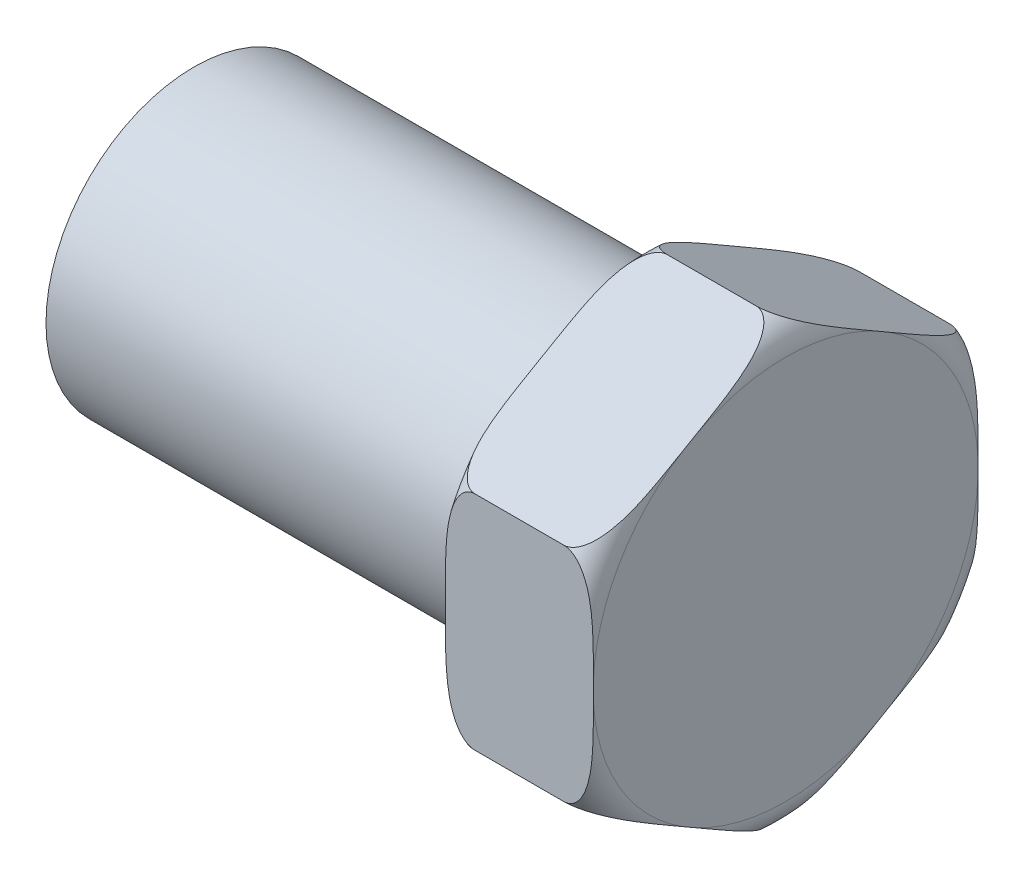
ISO-10303-21;
HEADER;
FILE_DESCRIPTION(('STEP AP214'),'2;1');
FILE_NAME('part.step','',(''),(''),'','','');
FILE_SCHEMA(('AUTOMOTIVE_DESIGN { 1 0 10303 214 1 1 1 1 }'));
ENDSEC;
DATA;
#1=APPLICATION_CONTEXT('core data for automotive mechanical design processes');
#2=APPLICATION_PROTOCOL_DEFINITION('international standard','automotive_design',2000,#1);
#3=PRODUCT_CONTEXT('',#1,'mechanical');
#4=PRODUCT('Part','Part','',(#3));
#5=PRODUCT_RELATED_PRODUCT_CATEGORY('part','',(#4));
#6=PRODUCT_DEFINITION_FORMATION('','',#4);
#7=PRODUCT_DEFINITION_CONTEXT('part definition',#1,'design');
#8=PRODUCT_DEFINITION('design','',#6,#7);
#9=PRODUCT_DEFINITION_SHAPE('','',#8);
#10=(LENGTH_UNIT() NAMED_UNIT(*) SI_UNIT(.MILLI.,.METRE.));
#11=(NAMED_UNIT(*) PLANE_ANGLE_UNIT() SI_UNIT($,.RADIAN.));
#12=(NAMED_UNIT(*) SI_UNIT($,.STERADIAN.) SOLID_ANGLE_UNIT());
#13=UNCERTAINTY_MEASURE_WITH_UNIT(LENGTH_MEASURE(1.E-05),#10,'distance_accuracy_value','');
#14=(GEOMETRIC_REPRESENTATION_CONTEXT(3) GLOBAL_UNCERTAINTY_ASSIGNED_CONTEXT((#13)) GLOBAL_UNIT_ASSIGNED_CONTEXT((#10,
#11,#12)) REPRESENTATION_CONTEXT('',''));
#15=CARTESIAN_POINT('',(0.,0.,0.));
#16=DIRECTION('',(0.,0.,1.));
#17=DIRECTION('',(1.,0.,0.));
#18=AXIS2_PLACEMENT_3D('',#15,#16,#17);
#19=CARTESIAN_POINT('',(6.35,1.19150661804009,-2.06375));
#20=DIRECTION('',(0.,-0.866025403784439,0.5));
#21=DIRECTION('',(0.,-0.5,-0.866025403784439));
#22=AXIS2_PLACEMENT_3D('',#19,#20,#21);
#23=PLANE('',#22);
#24=CARTESIAN_POINT('',(6.0323,1.19150668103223,-2.06374989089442));
#25=CARTESIAN_POINT('',(6.04180616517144,1.19148955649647,-2.0637795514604));
#26=CARTESIAN_POINT('',(6.05128967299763,1.19192096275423,-2.06303233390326));
#27=CARTESIAN_POINT('',(6.06989153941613,1.19358437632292,-2.06015121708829));
#28=CARTESIAN_POINT('',(6.07901232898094,1.19480949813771,-2.05802924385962));
#29=CARTESIAN_POINT('',(6.09671497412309,1.19796226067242,-2.0525684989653));
#30=CARTESIAN_POINT('',(6.10529826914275,1.19988792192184,-2.04923315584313));
#31=CARTESIAN_POINT('',(6.1218555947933,1.20432015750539,-2.0415562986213));
#32=CARTESIAN_POINT('',(6.12982819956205,1.20682803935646,-2.03721251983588));
#33=CARTESIAN_POINT('',(6.1501296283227,1.21410657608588,-2.02460572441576));
#34=CARTESIAN_POINT('',(6.1618785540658,1.2192812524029,-2.01564292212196));
#35=CARTESIAN_POINT('',(6.18363675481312,1.23047282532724,-1.9962585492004));
#36=CARTESIAN_POINT('',(6.19364119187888,1.23649198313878,-1.98583306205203));
#37=CARTESIAN_POINT('',(6.218872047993,1.25367920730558,-1.95606391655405));
#38=CARTESIAN_POINT('',(6.23258099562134,1.26539908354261,-1.9357644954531));
#39=CARTESIAN_POINT('',(6.25653664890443,1.28967172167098,-1.89372305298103));
#40=CARTESIAN_POINT('',(6.26677546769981,1.3022263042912,-1.87197787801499));
#41=CARTESIAN_POINT('',(6.28824001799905,1.33294981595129,-1.81876319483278));
#42=CARTESIAN_POINT('',(6.29819222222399,1.35133714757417,-1.78691540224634));
#43=CARTESIAN_POINT('',(6.31454014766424,1.38851431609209,-1.72252265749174));
#44=CARTESIAN_POINT('',(6.32092766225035,1.40730497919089,-1.68997627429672));
#45=CARTESIAN_POINT('',(6.33122232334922,1.44513732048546,-1.62444873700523));
#46=CARTESIAN_POINT('',(6.33511775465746,1.46417976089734,-1.59146626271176));
#47=CARTESIAN_POINT('',(6.34118000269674,1.50233501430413,-1.52537942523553));
#48=CARTESIAN_POINT('',(6.34334611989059,1.52144785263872,-1.49227501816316));
#49=CARTESIAN_POINT('',(6.34689022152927,1.56365866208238,-1.41916375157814));
#50=CARTESIAN_POINT('',(6.34801176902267,1.58676147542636,-1.37914850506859));
#51=CARTESIAN_POINT('',(6.34942296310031,1.63297705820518,-1.29910076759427));
#52=CARTESIAN_POINT('',(6.34971239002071,1.65608982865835,-1.2590682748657));
#53=CARTESIAN_POINT('',(6.35000151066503,1.70223730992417,-1.17913849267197));
#54=CARTESIAN_POINT('',(6.35000218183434,1.72527202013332,-1.13924120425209));
#55=CARTESIAN_POINT('',(6.34999754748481,1.77133920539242,-1.05945049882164));
#56=CARTESIAN_POINT('',(6.34999224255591,1.79437168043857,-1.01955708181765));
#57=CARTESIAN_POINT('',(6.35000761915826,1.8486068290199,-0.925619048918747));
#58=CARTESIAN_POINT('',(6.35003818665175,1.87980939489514,-0.871574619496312));
#59=CARTESIAN_POINT('',(6.34942719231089,1.94221872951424,-0.763478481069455));
#60=CARTESIAN_POINT('',(6.34878557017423,1.97342549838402,-0.709426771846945));
#61=CARTESIAN_POINT('',(6.3457954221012,2.025734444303,-0.618825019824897));
#62=CARTESIAN_POINT('',(6.34406543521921,2.04684335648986,-0.58226331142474));
#63=CARTESIAN_POINT('',(6.33881608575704,2.08904616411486,-0.509165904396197));
#64=CARTESIAN_POINT('',(6.33529350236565,2.110139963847,-0.472630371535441));
#65=CARTESIAN_POINT('',(6.32484719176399,2.15498835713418,-0.394950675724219));
#66=CARTESIAN_POINT('',(6.31753347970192,2.17872377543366,-0.353839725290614));
#67=CARTESIAN_POINT('',(6.30238643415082,2.21384530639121,-0.293007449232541));
#68=CARTESIAN_POINT('',(6.29665521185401,2.22545201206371,-0.27290404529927));
#69=CARTESIAN_POINT('',(6.28343200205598,2.24840800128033,-0.233143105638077));
#70=CARTESIAN_POINT('',(6.27594010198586,2.25975729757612,-0.21348554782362));
#71=CARTESIAN_POINT('',(6.25475971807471,2.28719823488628,-0.165956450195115));
#72=CARTESIAN_POINT('',(6.23980565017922,2.30307347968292,-0.138459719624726));
#73=CARTESIAN_POINT('',(6.21220549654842,2.3254103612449,-0.0997711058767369));
#74=CARTESIAN_POINT('',(6.20207760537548,2.33264365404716,-0.0872426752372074));
#75=CARTESIAN_POINT('',(6.17974681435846,2.34626603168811,-0.0636480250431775));
#76=CARTESIAN_POINT('',(6.16754949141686,2.35265730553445,-0.0525780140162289));
#77=CARTESIAN_POINT('',(6.14607933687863,2.36185617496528,-0.0366451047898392));
#78=CARTESIAN_POINT('',(6.1375336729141,2.36508661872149,-0.0310498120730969));
#79=CARTESIAN_POINT('',(6.11958516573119,2.37089384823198,-0.0209913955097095));
#80=CARTESIAN_POINT('',(6.11018291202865,2.37347107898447,-0.0165275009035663));
#81=CARTESIAN_POINT('',(6.09175167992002,2.37754492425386,-0.00947139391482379));
#82=CARTESIAN_POINT('',(6.082802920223,2.37913139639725,-0.0067235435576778));
#83=CARTESIAN_POINT('',(6.06450885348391,2.38152857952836,-0.00257150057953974));
#84=CARTESIAN_POINT('',(6.05516454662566,2.38234113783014,-0.00116410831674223));
#85=CARTESIAN_POINT('',(6.04128093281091,2.38292431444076,-0.000154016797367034));
#86=CARTESIAN_POINT('',(6.03678961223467,2.38301780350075,7.91100448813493E-06));
#87=CARTESIAN_POINT('',(6.0323,2.38301317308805,-1.0910557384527E-07));
#88=B_SPLINE_CURVE_WITH_KNOTS('',3,(#24,#25,#26,#27,#28,#29,#30,#31,#32,#33,#34,#35,#36,#37,#38,
#39,#40,#41,#42,#43,#44,#45,#46,#47,#48,#49,#50,#51,#52,#53,#54,#55,#56,#57,#58,#59,#60,#61,#62,
#63,#64,#65,#66,#67,#68,#69,#70,#71,#72,#73,#74,#75,#76,#77,#78,#79,#80,#81,#82,#83,#84,#85,#86,
#87),.UNSPECIFIED.,.F.,.F.,(4,2,2,2,2,2,2,2,2,2,2,2,2,2,2,2,2,2,2,2,2,2,2,2,2,2,2,2,2,2,2,4),
(0.,0.0284406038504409,0.0566377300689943,0.0847557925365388,0.112937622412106,0.15963752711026,
0.20646495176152,0.287467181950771,0.368652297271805,0.482648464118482,0.596906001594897,
0.711696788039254,0.826533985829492,0.965175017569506,1.10385264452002,1.24206084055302,
1.38025539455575,1.5674728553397,1.75470711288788,1.88144093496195,2.00840327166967,
2.15224869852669,2.22391708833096,2.29558192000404,2.40016678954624,2.45301123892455,
2.50571547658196,2.53776538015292,2.56979339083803,2.59815972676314,2.62645818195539,
2.63992777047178),.UNSPECIFIED.);
#89=CARTESIAN_POINT('',(6.0325,1.19150661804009,-2.06375));
#90=VERTEX_POINT('',#89);
#91=CARTESIAN_POINT('',(6.35,1.74459593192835,-1.10577120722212));
#92=VERTEX_POINT('',#91);
#93=EDGE_CURVE('E290',#90,#92,#88,.T.);
#94=ORIENTED_EDGE('',*,*,#93,.F.);
#95=DIRECTION('',(-1.,0.,0.));
#96=VECTOR('',#95,1.);
#97=CARTESIAN_POINT('',(6.35,1.19150661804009,-2.06375));
#98=LINE('',#97,#96);
#99=CARTESIAN_POINT('',(5.08,1.19150661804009,-2.06375));
#100=VERTEX_POINT('',#99);
#101=EDGE_CURVE('E478',#90,#100,#98,.T.);
#102=ORIENTED_EDGE('',*,*,#101,.T.);
#103=CARTESIAN_POINT('',(5.0802,2.38301317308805,-1.09105577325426E-07));
#104=CARTESIAN_POINT('',(5.07069383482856,2.3830302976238,2.95514604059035E-05));
#105=CARTESIAN_POINT('',(5.06121032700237,2.38259889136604,-0.000717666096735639));
#106=CARTESIAN_POINT('',(5.04260846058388,2.38093547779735,-0.00359878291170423));
#107=CARTESIAN_POINT('',(5.03348767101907,2.37971035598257,-0.00572075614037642));
#108=CARTESIAN_POINT('',(5.01578502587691,2.37655759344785,-0.0111815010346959));
#109=CARTESIAN_POINT('',(5.00720173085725,2.37463193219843,-0.0145168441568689));
#110=CARTESIAN_POINT('',(4.9906444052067,2.37019969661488,-0.0221937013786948));
#111=CARTESIAN_POINT('',(4.98267180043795,2.36769181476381,-0.0265374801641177));
#112=CARTESIAN_POINT('',(4.9623703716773,2.36041327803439,-0.0391442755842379));
#113=CARTESIAN_POINT('',(4.95062144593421,2.35523860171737,-0.0481070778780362));
#114=CARTESIAN_POINT('',(4.92886324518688,2.34404702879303,-0.0674914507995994));
#115=CARTESIAN_POINT('',(4.91885880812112,2.33802787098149,-0.077916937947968));
#116=CARTESIAN_POINT('',(4.893627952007,2.32084064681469,-0.107686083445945));
#117=CARTESIAN_POINT('',(4.87991900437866,2.30912077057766,-0.127985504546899));
#118=CARTESIAN_POINT('',(4.85596335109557,2.28484813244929,-0.170026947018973));
#119=CARTESIAN_POINT('',(4.8457245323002,2.27229354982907,-0.191772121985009));
#120=CARTESIAN_POINT('',(4.82425998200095,2.24157003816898,-0.244986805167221));
#121=CARTESIAN_POINT('',(4.81430777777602,2.2231827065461,-0.276834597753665));
#122=CARTESIAN_POINT('',(4.79795985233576,2.18600553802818,-0.34122734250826));
#123=CARTESIAN_POINT('',(4.79157233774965,2.16721487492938,-0.373773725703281));
#124=CARTESIAN_POINT('',(4.78127767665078,2.12938253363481,-0.439301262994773));
#125=CARTESIAN_POINT('',(4.77738224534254,2.11034009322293,-0.472283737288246));
#126=CARTESIAN_POINT('',(4.77131999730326,2.07218483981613,-0.53837057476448));
#127=CARTESIAN_POINT('',(4.76915388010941,2.05307200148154,-0.571474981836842));
#128=CARTESIAN_POINT('',(4.76560977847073,2.01086119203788,-0.644586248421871));
#129=CARTESIAN_POINT('',(4.76448823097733,1.98775837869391,-0.684601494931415));
#130=CARTESIAN_POINT('',(4.76307703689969,1.94154279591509,-0.764649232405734));
#131=CARTESIAN_POINT('',(4.76278760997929,1.91843002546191,-0.80468172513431));
#132=CARTESIAN_POINT('',(4.76249848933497,1.8722825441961,-0.884611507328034));
#133=CARTESIAN_POINT('',(4.76249781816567,1.84924783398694,-0.924508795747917));
#134=CARTESIAN_POINT('',(4.76250245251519,1.80318064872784,-1.00429950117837));
#135=CARTESIAN_POINT('',(4.76250775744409,1.7801481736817,-1.04419291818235));
#136=CARTESIAN_POINT('',(4.76249238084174,1.72591302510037,-1.13813095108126));
#137=CARTESIAN_POINT('',(4.76246181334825,1.69471045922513,-1.1921753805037));
#138=CARTESIAN_POINT('',(4.76307280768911,1.63230112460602,-1.30027151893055));
#139=CARTESIAN_POINT('',(4.76371442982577,1.60109435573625,-1.35432322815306));
#140=CARTESIAN_POINT('',(4.76670457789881,1.54878540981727,-1.44492498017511));
#141=CARTESIAN_POINT('',(4.76843456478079,1.5276764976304,-1.48148668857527));
#142=CARTESIAN_POINT('',(4.77368391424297,1.48547369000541,-1.55458409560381));
#143=CARTESIAN_POINT('',(4.77720649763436,1.46437989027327,-1.59111962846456));
#144=CARTESIAN_POINT('',(4.78765280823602,1.41953149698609,-1.66879932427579));
#145=CARTESIAN_POINT('',(4.79496652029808,1.39579607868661,-1.70991027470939));
#146=CARTESIAN_POINT('',(4.81011356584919,1.36067454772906,-1.77074255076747));
#147=CARTESIAN_POINT('',(4.815844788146,1.34906784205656,-1.79084595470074));
#148=CARTESIAN_POINT('',(4.82906799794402,1.32611185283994,-1.83060689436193));
#149=CARTESIAN_POINT('',(4.83655989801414,1.31476255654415,-1.85026445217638));
#150=CARTESIAN_POINT('',(4.8577402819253,1.28732161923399,-1.89779354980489));
#151=CARTESIAN_POINT('',(4.87269434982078,1.27144637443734,-1.92529028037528));
#152=CARTESIAN_POINT('',(4.90029450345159,1.24910949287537,-1.96397889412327));
#153=CARTESIAN_POINT('',(4.91042239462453,1.24187620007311,-1.97650732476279));
#154=CARTESIAN_POINT('',(4.93275318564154,1.22825382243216,-2.00010197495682));
#155=CARTESIAN_POINT('',(4.94495050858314,1.22186254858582,-2.01117198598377));
#156=CARTESIAN_POINT('',(4.96642066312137,1.21266367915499,-2.02710489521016));
#157=CARTESIAN_POINT('',(4.9749663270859,1.20943323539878,-2.0327001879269));
#158=CARTESIAN_POINT('',(4.99291483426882,1.20362600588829,-2.04275860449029));
#159=CARTESIAN_POINT('',(5.00231708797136,1.2010487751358,-2.04722249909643));
#160=CARTESIAN_POINT('',(5.02074832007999,1.19697492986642,-2.05427860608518));
#161=CARTESIAN_POINT('',(5.02969707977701,1.19538845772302,-2.05702645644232));
#162=CARTESIAN_POINT('',(5.0479911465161,1.19299127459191,-2.06117849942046));
#163=CARTESIAN_POINT('',(5.05733545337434,1.19217871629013,-2.06258589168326));
#164=CARTESIAN_POINT('',(5.0712190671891,1.19159553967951,-2.06359598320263));
#165=CARTESIAN_POINT('',(5.07571038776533,1.19150205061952,-2.06375791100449));
#166=CARTESIAN_POINT('',(5.0802,1.19150668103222,-2.06374989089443));
#167=B_SPLINE_CURVE_WITH_KNOTS('',3,(#103,#104,#105,#106,#107,#108,#109,#110,#111,#112,#113,
#114,#115,#116,#117,#118,#119,#120,#121,#122,#123,#124,#125,#126,#127,#128,#129,#130,#131,#132,
#133,#134,#135,#136,#137,#138,#139,#140,#141,#142,#143,#144,#145,#146,#147,#148,#149,#150,#151,
#152,#153,#154,#155,#156,#157,#158,#159,#160,#161,#162,#163,#164,#165,#166),.UNSPECIFIED.,.F.,
.F.,(4,2,2,2,2,2,2,2,2,2,2,2,2,2,2,2,2,2,2,2,2,2,2,2,2,2,2,2,2,2,2,4),(0.,0.0284406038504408,
0.0566377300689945,0.0847557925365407,0.112937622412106,0.159637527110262,0.206464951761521,
0.287467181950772,0.368652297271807,0.482648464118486,0.596906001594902,0.711696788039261,
0.8265339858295,0.965175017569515,1.10385264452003,1.24206084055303,1.38025539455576,
1.56747285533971,1.75470711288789,1.88144093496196,2.00840327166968,2.1522486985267,
2.22391708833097,2.29558192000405,2.40016678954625,2.45301123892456,2.50571547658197,
2.53776538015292,2.56979339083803,2.59815972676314,2.62645818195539,2.63992777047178),.UNSPECIFIED.);
#168=CARTESIAN_POINT('',(4.7625,1.74459593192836,-1.10577120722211));
#169=VERTEX_POINT('',#168);
#170=EDGE_CURVE('E224',#169,#100,#167,.T.);
#171=ORIENTED_EDGE('',*,*,#170,.F.);
#172=DIRECTION('',(0.,0.5,0.866025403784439));
#173=VECTOR('',#172,1.);
#174=CARTESIAN_POINT('',(4.7625,1.19150661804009,-2.06375));
#175=LINE('',#174,#173);
#176=CARTESIAN_POINT('',(4.7625,1.82992392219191,-0.957978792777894));
#177=VERTEX_POINT('',#176);
#178=EDGE_CURVE('E495',#169,#177,#175,.T.);
#179=ORIENTED_EDGE('',*,*,#178,.T.);
#180=CARTESIAN_POINT('',(5.08,2.38301323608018,0.));
#181=VERTEX_POINT('',#180);
#182=EDGE_CURVE('E280',#181,#177,#167,.T.);
#183=ORIENTED_EDGE('',*,*,#182,.F.);
#184=DIRECTION('',(-1.,0.,0.));
#185=VECTOR('',#184,1.);
#186=CARTESIAN_POINT('',(6.35,2.38301323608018,0.));
#187=LINE('',#186,#185);
#188=CARTESIAN_POINT('',(6.0325,2.38301323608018,0.));
#189=VERTEX_POINT('',#188);
#190=EDGE_CURVE('E183',#189,#181,#187,.T.);
#191=ORIENTED_EDGE('',*,*,#190,.F.);
#192=CARTESIAN_POINT('',(6.35,1.82992392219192,-0.957978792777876));
#193=VERTEX_POINT('',#192);
#194=EDGE_CURVE('E285',#193,#189,#88,.T.);
#195=ORIENTED_EDGE('',*,*,#194,.F.);
#196=DIRECTION('',(0.,0.5,0.866025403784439));
#197=VECTOR('',#196,1.);
#198=CARTESIAN_POINT('',(6.35,1.19150661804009,-2.06375));
#199=LINE('',#198,#197);
#200=EDGE_CURVE('E485',#92,#193,#199,.T.);
#201=ORIENTED_EDGE('',*,*,#200,.F.);
#202=EDGE_LOOP('',(#94,#102,#171,#179,#183,#191,#195,#201));
#203=FACE_BOUND('',#202,.T.);
#204=ADVANCED_FACE('F31',(#203),#23,.F.);
#205=CARTESIAN_POINT('',(6.35,2.38301323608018,0.));
#206=DIRECTION('',(0.,-0.866025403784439,-0.5));
#207=DIRECTION('',(0.,0.5,-0.866025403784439));
#208=AXIS2_PLACEMENT_3D('',#205,#206,#207);
#209=PLANE('',#208);
#210=CARTESIAN_POINT('',(6.0323,2.38301317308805,1.09105578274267E-07));
#211=CARTESIAN_POINT('',(6.04180616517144,2.3830302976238,-2.95514604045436E-05));
#212=CARTESIAN_POINT('',(6.05128967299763,2.38259889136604,0.000717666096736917));
#213=CARTESIAN_POINT('',(6.06989153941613,2.38093547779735,0.00359878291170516));
#214=CARTESIAN_POINT('',(6.07901232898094,2.37971035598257,0.00572075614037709));
#215=CARTESIAN_POINT('',(6.09671497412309,2.37655759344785,0.0111815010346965));
#216=CARTESIAN_POINT('',(6.10529826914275,2.37463193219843,0.0145168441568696));
#217=CARTESIAN_POINT('',(6.1218555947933,2.37019969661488,0.0221937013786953));
#218=CARTESIAN_POINT('',(6.12982819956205,2.36769181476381,0.0265374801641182));
#219=CARTESIAN_POINT('',(6.1501296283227,2.36041327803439,0.0391442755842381));
#220=CARTESIAN_POINT('',(6.1618785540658,2.35523860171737,0.0481070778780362));
#221=CARTESIAN_POINT('',(6.18363675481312,2.34404702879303,0.0674914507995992));
#222=CARTESIAN_POINT('',(6.19364119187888,2.33802787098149,0.0779169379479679));
#223=CARTESIAN_POINT('',(6.218872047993,2.32084064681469,0.107686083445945));
#224=CARTESIAN_POINT('',(6.23258099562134,2.30912077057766,0.127985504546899));
#225=CARTESIAN_POINT('',(6.25653664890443,2.28484813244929,0.170026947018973));
#226=CARTESIAN_POINT('',(6.26677546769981,2.27229354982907,0.191772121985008));
#227=CARTESIAN_POINT('',(6.28824001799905,2.24157003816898,0.24498680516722));
#228=CARTESIAN_POINT('',(6.29819222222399,2.2231827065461,0.276834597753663));
#229=CARTESIAN_POINT('',(6.31454014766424,2.18600553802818,0.341227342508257));
#230=CARTESIAN_POINT('',(6.32092766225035,2.16721487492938,0.373773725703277));
#231=CARTESIAN_POINT('',(6.33122232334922,2.12938253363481,0.439301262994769));
#232=CARTESIAN_POINT('',(6.33511775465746,2.11034009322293,0.472283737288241));
#233=CARTESIAN_POINT('',(6.34118000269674,2.07218483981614,0.538370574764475));
#234=CARTESIAN_POINT('',(6.34334611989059,2.05307200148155,0.571474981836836));
#235=CARTESIAN_POINT('',(6.34689022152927,2.01086119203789,0.644586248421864));
#236=CARTESIAN_POINT('',(6.34801176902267,1.98775837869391,0.684601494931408));
#237=CARTESIAN_POINT('',(6.34942296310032,1.94154279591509,0.764649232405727));
#238=CARTESIAN_POINT('',(6.34971239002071,1.91843002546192,0.804681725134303));
#239=CARTESIAN_POINT('',(6.35000151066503,1.8722825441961,0.884611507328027));
#240=CARTESIAN_POINT('',(6.35000218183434,1.84924783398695,0.92450879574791));
#241=CARTESIAN_POINT('',(6.34999754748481,1.80318064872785,1.00429950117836));
#242=CARTESIAN_POINT('',(6.34999224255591,1.7801481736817,1.04419291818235));
#243=CARTESIAN_POINT('',(6.35000761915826,1.72591302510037,1.13813095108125));
#244=CARTESIAN_POINT('',(6.35003818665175,1.69471045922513,1.19217538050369));
#245=CARTESIAN_POINT('',(6.34942719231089,1.63230112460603,1.30027151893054));
#246=CARTESIAN_POINT('',(6.34878557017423,1.60109435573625,1.35432322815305));
#247=CARTESIAN_POINT('',(6.3457954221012,1.54878540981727,1.4449249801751));
#248=CARTESIAN_POINT('',(6.34406543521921,1.52767649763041,1.48148668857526));
#249=CARTESIAN_POINT('',(6.33881608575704,1.48547369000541,1.5545840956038));
#250=CARTESIAN_POINT('',(6.33529350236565,1.46437989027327,1.59111962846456));
#251=CARTESIAN_POINT('',(6.32484719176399,1.41953149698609,1.66879932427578));
#252=CARTESIAN_POINT('',(6.31753347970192,1.39579607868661,1.70991027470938));
#253=CARTESIAN_POINT('',(6.30238643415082,1.36067454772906,1.77074255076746));
#254=CARTESIAN_POINT('',(6.29665521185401,1.34906784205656,1.79084595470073));
#255=CARTESIAN_POINT('',(6.28343200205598,1.32611185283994,1.83060689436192));
#256=CARTESIAN_POINT('',(6.27594010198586,1.31476255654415,1.85026445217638));
#257=CARTESIAN_POINT('',(6.25475971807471,1.287321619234,1.89779354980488));
#258=CARTESIAN_POINT('',(6.23980565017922,1.27144637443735,1.92529028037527));
#259=CARTESIAN_POINT('',(6.21220549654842,1.24910949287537,1.96397889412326));
#260=CARTESIAN_POINT('',(6.20207760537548,1.24187620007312,1.97650732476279));
#261=CARTESIAN_POINT('',(6.17974681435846,1.22825382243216,2.00010197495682));
#262=CARTESIAN_POINT('',(6.16754949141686,1.22186254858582,2.01117198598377));
#263=CARTESIAN_POINT('',(6.14607933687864,1.21266367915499,2.02710489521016));
#264=CARTESIAN_POINT('',(6.1375336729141,1.20943323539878,2.0327001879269));
#265=CARTESIAN_POINT('',(6.11958516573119,1.20362600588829,2.04275860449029));
#266=CARTESIAN_POINT('',(6.11018291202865,1.2010487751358,2.04722249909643));
#267=CARTESIAN_POINT('',(6.09175167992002,1.19697492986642,2.05427860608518));
#268=CARTESIAN_POINT('',(6.082802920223,1.19538845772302,2.05702645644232));
#269=CARTESIAN_POINT('',(6.06450885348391,1.19299127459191,2.06117849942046));
#270=CARTESIAN_POINT('',(6.05516454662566,1.19217871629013,2.06258589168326));
#271=CARTESIAN_POINT('',(6.04128093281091,1.19159553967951,2.06359598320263));
#272=CARTESIAN_POINT('',(6.03678961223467,1.19150205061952,2.06375791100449));
#273=CARTESIAN_POINT('',(6.0323,1.19150668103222,2.06374989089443));
#274=B_SPLINE_CURVE_WITH_KNOTS('',3,(#210,#211,#212,#213,#214,#215,#216,#217,#218,#219,#220,
#221,#222,#223,#224,#225,#226,#227,#228,#229,#230,#231,#232,#233,#234,#235,#236,#237,#238,#239,
#240,#241,#242,#243,#244,#245,#246,#247,#248,#249,#250,#251,#252,#253,#254,#255,#256,#257,#258,
#259,#260,#261,#262,#263,#264,#265,#266,#267,#268,#269,#270,#271,#272,#273),.UNSPECIFIED.,.F.,
.F.,(4,2,2,2,2,2,2,2,2,2,2,2,2,2,2,2,2,2,2,2,2,2,2,2,2,2,2,2,2,2,2,4),(0.,0.0284406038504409,
0.0566377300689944,0.0847557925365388,0.112937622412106,0.15963752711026,0.20646495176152,
0.287467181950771,0.368652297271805,0.482648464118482,0.596906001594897,0.711696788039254,
0.826533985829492,0.965175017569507,1.10385264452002,1.24206084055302,1.38025539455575,
1.5674728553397,1.75470711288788,1.88144093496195,2.00840327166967,2.15224869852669,
2.22391708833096,2.29558192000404,2.40016678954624,2.45301123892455,2.50571547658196,
2.53776538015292,2.56979339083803,2.59815972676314,2.62645818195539,2.63992777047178),.UNSPECIFIED.);
#275=CARTESIAN_POINT('',(6.35,1.82992392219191,0.957978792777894));
#276=VERTEX_POINT('',#275);
#277=EDGE_CURVE('E165',#189,#276,#274,.T.);
#278=ORIENTED_EDGE('',*,*,#277,.F.);
#279=ORIENTED_EDGE('',*,*,#190,.T.);
#280=CARTESIAN_POINT('',(5.0802,1.19150668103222,2.06374989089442));
#281=CARTESIAN_POINT('',(5.07069383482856,1.19148955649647,2.0637795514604));
#282=CARTESIAN_POINT('',(5.06121032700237,1.19192096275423,2.06303233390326));
#283=CARTESIAN_POINT('',(5.04260846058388,1.19358437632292,2.0601512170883));
#284=CARTESIAN_POINT('',(5.03348767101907,1.1948094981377,2.05802924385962));
#285=CARTESIAN_POINT('',(5.01578502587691,1.19796226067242,2.0525684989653));
#286=CARTESIAN_POINT('',(5.00720173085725,1.19988792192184,2.04923315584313));
#287=CARTESIAN_POINT('',(4.9906444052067,1.20432015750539,2.0415562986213));
#288=CARTESIAN_POINT('',(4.98267180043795,1.20682803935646,2.03721251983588));
#289=CARTESIAN_POINT('',(4.9623703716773,1.21410657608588,2.02460572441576));
#290=CARTESIAN_POINT('',(4.95062144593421,1.2192812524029,2.01564292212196));
#291=CARTESIAN_POINT('',(4.92886324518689,1.23047282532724,1.9962585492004));
#292=CARTESIAN_POINT('',(4.91885880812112,1.23649198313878,1.98583306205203));
#293=CARTESIAN_POINT('',(4.89362795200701,1.25367920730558,1.95606391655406));
#294=CARTESIAN_POINT('',(4.87991900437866,1.26539908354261,1.9357644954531));
#295=CARTESIAN_POINT('',(4.85596335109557,1.28967172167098,1.89372305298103));
#296=CARTESIAN_POINT('',(4.8457245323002,1.3022263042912,1.871977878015));
#297=CARTESIAN_POINT('',(4.82425998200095,1.33294981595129,1.81876319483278));
#298=CARTESIAN_POINT('',(4.81430777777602,1.35133714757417,1.78691540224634));
#299=CARTESIAN_POINT('',(4.79795985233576,1.38851431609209,1.72252265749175));
#300=CARTESIAN_POINT('',(4.79157233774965,1.40730497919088,1.68997627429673));
#301=CARTESIAN_POINT('',(4.78127767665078,1.44513732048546,1.62444873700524));
#302=CARTESIAN_POINT('',(4.77738224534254,1.46417976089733,1.59146626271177));
#303=CARTESIAN_POINT('',(4.77131999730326,1.50233501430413,1.52537942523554));
#304=CARTESIAN_POINT('',(4.76915388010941,1.52144785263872,1.49227501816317));
#305=CARTESIAN_POINT('',(4.76560977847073,1.56365866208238,1.41916375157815));
#306=CARTESIAN_POINT('',(4.76448823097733,1.58676147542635,1.3791485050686));
#307=CARTESIAN_POINT('',(4.76307703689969,1.63297705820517,1.29910076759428));
#308=CARTESIAN_POINT('',(4.76278760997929,1.65608982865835,1.2590682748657));
#309=CARTESIAN_POINT('',(4.76249848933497,1.70223730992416,1.17913849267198));
#310=CARTESIAN_POINT('',(4.76249781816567,1.72527202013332,1.1392412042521));
#311=CARTESIAN_POINT('',(4.76250245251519,1.77133920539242,1.05945049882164));
#312=CARTESIAN_POINT('',(4.76250775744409,1.79437168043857,1.01955708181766));
#313=CARTESIAN_POINT('',(4.76249238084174,1.8486068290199,0.925619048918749));
#314=CARTESIAN_POINT('',(4.76246181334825,1.87980939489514,0.871574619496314));
#315=CARTESIAN_POINT('',(4.76307280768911,1.94221872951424,0.763478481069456));
#316=CARTESIAN_POINT('',(4.76371442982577,1.97342549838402,0.709426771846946));
#317=CARTESIAN_POINT('',(4.7667045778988,2.025734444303,0.618825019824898));
#318=CARTESIAN_POINT('',(4.76843456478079,2.04684335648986,0.58226331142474));
#319=CARTESIAN_POINT('',(4.77368391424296,2.08904616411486,0.509165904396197));
#320=CARTESIAN_POINT('',(4.77720649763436,2.110139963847,0.472630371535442));
#321=CARTESIAN_POINT('',(4.78765280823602,2.15498835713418,0.394950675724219));
#322=CARTESIAN_POINT('',(4.79496652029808,2.17872377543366,0.353839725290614));
#323=CARTESIAN_POINT('',(4.81011356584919,2.21384530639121,0.29300744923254));
#324=CARTESIAN_POINT('',(4.815844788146,2.22545201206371,0.27290404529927));
#325=CARTESIAN_POINT('',(4.82906799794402,2.24840800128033,0.233143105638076));
#326=CARTESIAN_POINT('',(4.83655989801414,2.25975729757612,0.21348554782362));
#327=CARTESIAN_POINT('',(4.85774028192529,2.28719823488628,0.165956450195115));
#328=CARTESIAN_POINT('',(4.87269434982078,2.30307347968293,0.138459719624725));
#329=CARTESIAN_POINT('',(4.90029450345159,2.3254103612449,0.0997711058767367));
#330=CARTESIAN_POINT('',(4.91042239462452,2.33264365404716,0.087242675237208));
#331=CARTESIAN_POINT('',(4.93275318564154,2.34626603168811,0.0636480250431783));
#332=CARTESIAN_POINT('',(4.94495050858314,2.35265730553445,0.052578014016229));
#333=CARTESIAN_POINT('',(4.96642066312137,2.36185617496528,0.036645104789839));
#334=CARTESIAN_POINT('',(4.9749663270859,2.36508661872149,0.0310498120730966));
#335=CARTESIAN_POINT('',(4.99291483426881,2.37089384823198,0.0209913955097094));
#336=CARTESIAN_POINT('',(5.00231708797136,2.37347107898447,0.0165275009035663));
#337=CARTESIAN_POINT('',(5.02074832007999,2.37754492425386,0.00947139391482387));
#338=CARTESIAN_POINT('',(5.02969707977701,2.37913139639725,0.0067235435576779));
#339=CARTESIAN_POINT('',(5.04799114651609,2.38152857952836,0.00257150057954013));
#340=CARTESIAN_POINT('',(5.05733545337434,2.38234113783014,0.00116410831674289));
#341=CARTESIAN_POINT('',(5.0712190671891,2.38292431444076,0.000154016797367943));
#342=CARTESIAN_POINT('',(5.07571038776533,2.38301780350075,-7.91100448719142E-06));
#343=CARTESIAN_POINT('',(5.0802,2.38301317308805,1.09105574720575E-07));
#344=B_SPLINE_CURVE_WITH_KNOTS('',3,(#280,#281,#282,#283,#284,#285,#286,#287,#288,#289,#290,
#291,#292,#293,#294,#295,#296,#297,#298,#299,#300,#301,#302,#303,#304,#305,#306,#307,#308,#309,
#310,#311,#312,#313,#314,#315,#316,#317,#318,#319,#320,#321,#322,#323,#324,#325,#326,#327,#328,
#329,#330,#331,#332,#333,#334,#335,#336,#337,#338,#339,#340,#341,#342,#343),.UNSPECIFIED.,.F.,
.F.,(4,2,2,2,2,2,2,2,2,2,2,2,2,2,2,2,2,2,2,2,2,2,2,2,2,2,2,2,2,2,2,4),(0.,0.0284406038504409,
0.0566377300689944,0.0847557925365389,0.112937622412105,0.159637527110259,0.206464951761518,
0.287467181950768,0.368652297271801,0.482648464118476,0.596906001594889,0.711696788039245,
0.82653398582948,0.965175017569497,1.10385264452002,1.24206084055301,1.38025539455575,
1.5674728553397,1.75470711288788,1.88144093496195,2.00840327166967,2.15224869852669,
2.22391708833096,2.29558192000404,2.40016678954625,2.45301123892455,2.50571547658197,
2.53776538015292,2.56979339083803,2.59815972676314,2.62645818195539,2.63992777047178),.UNSPECIFIED.);
#345=CARTESIAN_POINT('',(4.7625,1.82992392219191,0.957978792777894));
#346=VERTEX_POINT('',#345);
#347=EDGE_CURVE('E514',#346,#181,#344,.T.);
#348=ORIENTED_EDGE('',*,*,#347,.F.);
#349=DIRECTION('',(0.,-0.5,0.866025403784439));
#350=VECTOR('',#349,1.);
#351=CARTESIAN_POINT('',(4.7625,2.38301323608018,0.));
#352=LINE('',#351,#350);
#353=CARTESIAN_POINT('',(4.7625,1.74459593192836,1.10577120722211));
#354=VERTEX_POINT('',#353);
#355=EDGE_CURVE('E493',#346,#354,#352,.T.);
#356=ORIENTED_EDGE('',*,*,#355,.T.);
#357=CARTESIAN_POINT('',(5.08,1.19150661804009,2.06375));
#358=VERTEX_POINT('',#357);
#359=EDGE_CURVE('E182',#358,#354,#344,.T.);
#360=ORIENTED_EDGE('',*,*,#359,.F.);
#361=DIRECTION('',(-1.,0.,0.));
#362=VECTOR('',#361,1.);
#363=CARTESIAN_POINT('',(6.35,1.19150661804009,2.06375));
#364=LINE('',#363,#362);
#365=CARTESIAN_POINT('',(6.0325,1.19150661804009,2.06375));
#366=VERTEX_POINT('',#365);
#367=EDGE_CURVE('E172',#366,#358,#364,.T.);
#368=ORIENTED_EDGE('',*,*,#367,.F.);
#369=CARTESIAN_POINT('',(6.35,1.74459593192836,1.10577120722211));
#370=VERTEX_POINT('',#369);
#371=EDGE_CURVE('E155',#370,#366,#274,.T.);
#372=ORIENTED_EDGE('',*,*,#371,.F.);
#373=DIRECTION('',(0.,-0.5,0.866025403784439));
#374=VECTOR('',#373,1.);
#375=CARTESIAN_POINT('',(6.35,2.38301323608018,0.));
#376=LINE('',#375,#374);
#377=EDGE_CURVE('E505',#276,#370,#376,.T.);
#378=ORIENTED_EDGE('',*,*,#377,.F.);
#379=EDGE_LOOP('',(#278,#279,#348,#356,#360,#368,#372,#378));
#380=FACE_BOUND('',#379,.T.);
#381=ADVANCED_FACE('F180',(#380),#209,.F.);
#382=CARTESIAN_POINT('',(6.35,1.19150661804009,2.06375));
#383=DIRECTION('',(0.,0.,-1.));
#384=DIRECTION('',(-1.,0.,0.));
#385=AXIS2_PLACEMENT_3D('',#382,#383,#384);
#386=PLANE('',#385);
#387=CARTESIAN_POINT('',(6.34999510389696,0.,2.06375));
#388=CARTESIAN_POINT('',(6.34998918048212,-0.0529774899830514,2.06375));
#389=CARTESIAN_POINT('',(6.35002460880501,-0.105955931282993,2.06375));
#390=CARTESIAN_POINT('',(6.34991580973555,-0.211955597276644,2.06375));
#391=CARTESIAN_POINT('',(6.34977143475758,-0.264976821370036,2.06375));
#392=CARTESIAN_POINT('',(6.34862011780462,-0.370903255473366,2.06375));
#393=CARTESIAN_POINT('',(6.3476150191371,-0.423808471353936,2.06375));
#394=CARTESIAN_POINT('',(6.34362056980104,-0.529518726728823,2.06375));
#395=CARTESIAN_POINT('',(6.34063253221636,-0.582323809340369,2.06375));
#396=CARTESIAN_POINT('',(6.3310230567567,-0.688221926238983,2.06375));
#397=CARTESIAN_POINT('',(6.32436429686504,-0.741312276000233,2.06375));
#398=CARTESIAN_POINT('',(6.30976418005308,-0.820021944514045,2.06375));
#399=CARTESIAN_POINT('',(6.30414352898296,-0.84605660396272,2.06375));
#400=CARTESIAN_POINT('',(6.29091129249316,-0.897605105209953,2.06375));
#401=CARTESIAN_POINT('',(6.28330020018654,-0.92311907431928,2.06375));
#402=CARTESIAN_POINT('',(6.26249026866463,-0.981787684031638,2.06375));
#403=CARTESIAN_POINT('',(6.24827277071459,-1.01462021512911,2.06375));
#404=CARTESIAN_POINT('',(6.22190829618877,-1.06122649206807,2.06375));
#405=CARTESIAN_POINT('',(6.21222578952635,-1.0763831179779,2.06375));
#406=CARTESIAN_POINT('',(6.19081939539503,-1.10519133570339,2.06375));
#407=CARTESIAN_POINT('',(6.17909997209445,-1.11884611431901,2.06375));
#408=CARTESIAN_POINT('',(6.15799557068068,-1.13922864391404,2.06375));
#409=CARTESIAN_POINT('',(6.14930607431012,-1.1466722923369,2.06375));
#410=CARTESIAN_POINT('',(6.13093415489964,-1.16023882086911,2.06375));
#411=CARTESIAN_POINT('',(6.12125193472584,-1.16636197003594,2.06375));
#412=CARTESIAN_POINT('',(6.10083247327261,-1.17692946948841,2.06375));
#413=CARTESIAN_POINT('',(6.09008330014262,-1.18135129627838,2.06375));
#414=CARTESIAN_POINT('',(6.06791549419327,-1.18793831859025,2.06375));
#415=CARTESIAN_POINT('',(6.05649821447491,-1.19010791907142,2.06375));
#416=CARTESIAN_POINT('',(6.0351907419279,-1.19178740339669,2.06375));
#417=CARTESIAN_POINT('',(6.02532731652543,-1.19164630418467,2.06375));
#418=CARTESIAN_POINT('',(6.00579357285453,-1.18955757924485,2.06375));
#419=CARTESIAN_POINT('',(5.9961233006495,-1.18760952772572,2.06375));
#420=CARTESIAN_POINT('',(5.97798790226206,-1.18230102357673,2.06375));
#421=CARTESIAN_POINT('',(5.969487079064,-1.17905941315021,2.06375));
#422=CARTESIAN_POINT('',(5.95303703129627,-1.17140623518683,2.06375));
#423=CARTESIAN_POINT('',(5.94508792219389,-1.16699442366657,2.06375));
#424=CARTESIAN_POINT('',(5.92524543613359,-1.1543052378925,2.06375));
#425=CARTESIAN_POINT('',(5.91382372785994,-1.14529083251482,2.06375));
#426=CARTESIAN_POINT('',(5.89252402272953,-1.12558938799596,2.06375));
#427=CARTESIAN_POINT('',(5.88265082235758,-1.11489734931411,2.06375));
#428=CARTESIAN_POINT('',(5.85809507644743,-1.08477112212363,2.06375));
#429=CARTESIAN_POINT('',(5.84467658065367,-1.06431548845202,2.06375));
#430=CARTESIAN_POINT('',(5.82093212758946,-1.02172753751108,2.06375));
#431=CARTESIAN_POINT('',(5.81061185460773,-0.999592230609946,2.06375));
#432=CARTESIAN_POINT('',(5.789716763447,-0.94780119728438,2.06375));
#433=CARTESIAN_POINT('',(5.77993931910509,-0.917829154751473,2.06375));
#434=CARTESIAN_POINT('',(5.76329193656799,-0.857069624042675,2.06375));
#435=CARTESIAN_POINT('',(5.75642777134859,-0.826280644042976,2.06375));
#436=CARTESIAN_POINT('',(5.74483623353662,-0.764118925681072,2.06375));
#437=CARTESIAN_POINT('',(5.74012230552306,-0.73274375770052,2.06375));
#438=CARTESIAN_POINT('',(5.73232593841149,-0.669830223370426,2.06375));
#439=CARTESIAN_POINT('',(5.72924202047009,-0.638292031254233,2.06375));
#440=CARTESIAN_POINT('',(5.72355997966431,-0.566323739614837,2.06375));
#441=CARTESIAN_POINT('',(5.7213368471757,-0.525865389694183,2.06375));
#442=CARTESIAN_POINT('',(5.71810490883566,-0.444897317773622,2.06375));
#443=CARTESIAN_POINT('',(5.71709642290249,-0.40438758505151,2.06375));
#444=CARTESIAN_POINT('',(5.71575719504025,-0.323320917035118,2.06375));
#445=CARTESIAN_POINT('',(5.71542709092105,-0.282763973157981,2.06375));
#446=CARTESIAN_POINT('',(5.71505746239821,-0.201648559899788,2.06375));
#447=CARTESIAN_POINT('',(5.71501794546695,-0.161090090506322,2.06375));
#448=CARTESIAN_POINT('',(5.71499176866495,-0.0800638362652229,2.06375));
#449=CARTESIAN_POINT('',(5.7150049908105,-0.0395960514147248,2.06375));
#450=CARTESIAN_POINT('',(5.71500479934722,0.0413410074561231,2.06375));
#451=CARTESIAN_POINT('',(5.7149913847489,0.0818102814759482,2.06375));
#452=CARTESIAN_POINT('',(5.71501945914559,0.162725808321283,2.06375));
#453=CARTESIAN_POINT('',(5.71506091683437,0.203172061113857,2.06375));
#454=CARTESIAN_POINT('',(5.71543661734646,0.284062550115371,2.06375));
#455=CARTESIAN_POINT('',(5.71577085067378,0.324506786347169,2.06375));
#456=CARTESIAN_POINT('',(5.71712090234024,0.405499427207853,2.06375));
#457=CARTESIAN_POINT('',(5.71813861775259,0.44604780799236,2.06375));
#458=CARTESIAN_POINT('',(5.72139970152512,0.527124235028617,2.06375));
#459=CARTESIAN_POINT('',(5.72364378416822,0.567652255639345,2.06375));
#460=CARTESIAN_POINT('',(5.73007850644,0.648610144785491,2.06375));
#461=CARTESIAN_POINT('',(5.73427105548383,0.689039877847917,2.06375));
#462=CARTESIAN_POINT('',(5.74556062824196,0.769454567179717,2.06375));
#463=CARTESIAN_POINT('',(5.75265394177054,0.809440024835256,2.06375));
#464=CARTESIAN_POINT('',(5.77124225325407,0.889130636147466,2.06375));
#465=CARTESIAN_POINT('',(5.78280276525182,0.928822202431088,2.06375));
#466=CARTESIAN_POINT('',(5.80503928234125,0.986379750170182,2.06375));
#467=CARTESIAN_POINT('',(5.81324106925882,1.00519142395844,2.06375));
#468=CARTESIAN_POINT('',(5.83166706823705,1.04178181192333,2.06375));
#469=CARTESIAN_POINT('',(5.84188697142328,1.05956262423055,2.06375));
#470=CARTESIAN_POINT('',(5.86262662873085,1.09020792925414,2.06375));
#471=CARTESIAN_POINT('',(5.87271355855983,1.10336155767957,2.06375));
#472=CARTESIAN_POINT('',(5.89478765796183,1.12797065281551,2.06375));
#473=CARTESIAN_POINT('',(5.90676966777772,1.13943057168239,2.06375));
#474=CARTESIAN_POINT('',(5.92825391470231,1.15619547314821,2.06375));
#475=CARTESIAN_POINT('',(5.93716485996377,1.16225353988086,2.06375));
#476=CARTESIAN_POINT('',(5.95582833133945,1.17291748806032,2.06375));
#477=CARTESIAN_POINT('',(5.9655804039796,1.17752414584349,2.06375));
#478=CARTESIAN_POINT('',(5.98587713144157,1.18495549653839,2.06375));
#479=CARTESIAN_POINT('',(5.99642924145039,1.18776030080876,2.06375));
#480=CARTESIAN_POINT('',(6.01787989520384,1.19119732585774,2.06375));
#481=CARTESIAN_POINT('',(6.02877800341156,1.19183217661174,2.06375));
#482=CARTESIAN_POINT('',(6.04887566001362,1.19093266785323,2.06375));
#483=CARTESIAN_POINT('',(6.05809030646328,1.18970226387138,2.06375));
#484=CARTESIAN_POINT('',(6.07618345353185,1.18572203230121,2.06375));
#485=CARTESIAN_POINT('',(6.08506179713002,1.182971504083,2.06375));
#486=CARTESIAN_POINT('',(6.10450623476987,1.17527699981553,2.06375));
#487=CARTESIAN_POINT('',(6.11492021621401,1.16995112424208,2.06375));
#488=CARTESIAN_POINT('',(6.13474749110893,1.15768636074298,2.06375));
#489=CARTESIAN_POINT('',(6.14415883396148,1.150744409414,2.06375));
#490=CARTESIAN_POINT('',(6.16643416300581,1.13187746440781,2.06375));
#491=CARTESIAN_POINT('',(6.17865722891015,1.11920119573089,2.06375));
#492=CARTESIAN_POINT('',(6.20103786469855,1.09216385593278,2.06375));
#493=CARTESIAN_POINT('',(6.21119114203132,1.0777993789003,2.06375));
#494=CARTESIAN_POINT('',(6.23740711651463,1.03575212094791,2.06375));
#495=CARTESIAN_POINT('',(6.25146698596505,1.00682750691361,2.06375));
#496=CARTESIAN_POINT('',(6.2694491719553,0.962264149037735,2.06375));
#497=CARTESIAN_POINT('',(6.27493235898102,0.947185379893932,2.06375));
#498=CARTESIAN_POINT('',(6.28500505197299,0.916737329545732,2.06375));
#499=CARTESIAN_POINT('',(6.28959518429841,0.901368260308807,2.06375));
#500=CARTESIAN_POINT('',(6.30347347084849,0.850405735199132,2.06375));
#501=CARTESIAN_POINT('',(6.31115424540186,0.814378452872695,2.06375));
#502=CARTESIAN_POINT('',(6.32373073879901,0.741829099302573,2.06375));
#503=CARTESIAN_POINT('',(6.32862259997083,0.705306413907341,2.06375));
#504=CARTESIAN_POINT('',(6.33645578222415,0.631898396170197,2.06375));
#505=CARTESIAN_POINT('',(6.33938837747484,0.595012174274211,2.06375));
#506=CARTESIAN_POINT('',(6.34389847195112,0.521153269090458,2.06375));
#507=CARTESIAN_POINT('',(6.34547556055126,0.484180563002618,2.06375));
#508=CARTESIAN_POINT('',(6.34896022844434,0.372600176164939,2.06375));
#509=CARTESIAN_POINT('',(6.34957269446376,0.297958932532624,2.06375));
#510=CARTESIAN_POINT('',(6.35009339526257,0.148879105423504,2.06375));
#511=CARTESIAN_POINT('',(6.35000342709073,0.0744404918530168,2.06375));
#512=CARTESIAN_POINT('',(6.34999510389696,0.,2.06375));
#513=B_SPLINE_CURVE_WITH_KNOTS('',3,(#387,#388,#389,#390,#391,#392,#393,#394,#395,#396,#397,
#398,#399,#400,#401,#402,#403,#404,#405,#406,#407,#408,#409,#410,#411,#412,#413,#414,#415,#416,
#417,#418,#419,#420,#421,#422,#423,#424,#425,#426,#427,#428,#429,#430,#431,#432,#433,#434,#435,
#436,#437,#438,#439,#440,#441,#442,#443,#444,#445,#446,#447,#448,#449,#450,#451,#452,#453,#454,
#455,#456,#457,#458,#459,#460,#461,#462,#463,#464,#465,#466,#467,#468,#469,#470,#471,#472,#473,
#474,#475,#476,#477,#478,#479,#480,#481,#482,#483,#484,#485,#486,#487,#488,#489,#490,#491,#492,
#493,#494,#495,#496,#497,#498,#499,#500,#501,#502,#503,#504,#505,#506,#507,#508,#509,#510,#511,
#512),.UNSPECIFIED.,.T.,.F.,(4,2,2,2,2,2,2,2,2,2,2,2,2,2,2,2,2,2,2,2,2,2,2,2,2,2,2,2,2,2,2,2,2,
2,2,2,2,2,2,2,2,2,2,2,2,2,2,2,2,2,2,2,2,2,2,2,2,2,2,2,2,2,4),(0.,0.158934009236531,
0.317998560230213,0.476723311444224,0.635343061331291,0.795606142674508,0.875441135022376,
0.955256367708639,1.06196448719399,1.11580113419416,1.16952124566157,1.2037528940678,
1.23797756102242,1.27264089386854,1.307236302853,1.33666175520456,1.36609414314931,
1.39328540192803,1.42048233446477,1.46388274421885,1.50741503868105,1.58039224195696,
1.65350252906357,1.74785630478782,1.84239618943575,1.93751935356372,2.03255606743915,
2.15408209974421,2.27564013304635,2.39731240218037,2.51898780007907,2.6403911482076,
2.76179900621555,2.88313762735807,3.0044723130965,3.12614517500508,3.24788897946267,
3.36975234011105,3.49146031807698,3.61502544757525,3.67650391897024,3.73785252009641,
3.78744389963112,3.83690250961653,3.8691226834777,3.90132559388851,3.93387811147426,
3.96639116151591,3.9941444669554,4.02191057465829,4.05680734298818,4.09177080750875,
4.14430021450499,4.19693747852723,4.29284239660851,4.34096864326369,4.38906101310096,
4.49938984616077,4.60987091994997,4.72084081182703,4.83184430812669,5.0557405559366,
5.27906419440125),.UNSPECIFIED.);
#514=CARTESIAN_POINT('',(6.35,-0.0853279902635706,2.06375));
#515=VERTEX_POINT('',#514);
#516=CARTESIAN_POINT('',(6.0325,-1.19150661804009,2.06375));
#517=VERTEX_POINT('',#516);
#518=EDGE_CURVE('E176',#515,#517,#513,.T.);
#519=ORIENTED_EDGE('',*,*,#518,.F.);
#520=DIRECTION('',(0.,-1.,0.));
#521=VECTOR('',#520,1.);
#522=CARTESIAN_POINT('',(6.35,1.19150661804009,2.06375));
#523=LINE('',#522,#521);
#524=CARTESIAN_POINT('',(6.35,0.0853279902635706,2.06375));
#525=VERTEX_POINT('',#524);
#526=EDGE_CURVE('E175',#525,#515,#523,.T.);
#527=ORIENTED_EDGE('',*,*,#526,.F.);
#528=EDGE_CURVE('E158',#366,#525,#513,.T.);
#529=ORIENTED_EDGE('',*,*,#528,.F.);
#530=ORIENTED_EDGE('',*,*,#367,.T.);
#531=CARTESIAN_POINT('',(4.76250489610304,0.,2.06375));
#532=CARTESIAN_POINT('',(4.76251081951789,0.0529774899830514,2.06375));
#533=CARTESIAN_POINT('',(4.76247539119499,0.105955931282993,2.06375));
#534=CARTESIAN_POINT('',(4.76258419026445,0.211955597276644,2.06375));
#535=CARTESIAN_POINT('',(4.76272856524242,0.264976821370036,2.06375));
#536=CARTESIAN_POINT('',(4.76387988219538,0.370903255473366,2.06375));
#537=CARTESIAN_POINT('',(4.76488498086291,0.423808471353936,2.06375));
#538=CARTESIAN_POINT('',(4.76887943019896,0.529518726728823,2.06375));
#539=CARTESIAN_POINT('',(4.77186746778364,0.582323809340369,2.06375));
#540=CARTESIAN_POINT('',(4.7814769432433,0.688221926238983,2.06375));
#541=CARTESIAN_POINT('',(4.78813570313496,0.741312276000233,2.06375));
#542=CARTESIAN_POINT('',(4.80273581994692,0.820021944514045,2.06375));
#543=CARTESIAN_POINT('',(4.80835647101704,0.84605660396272,2.06375));
#544=CARTESIAN_POINT('',(4.82158870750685,0.897605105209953,2.06375));
#545=CARTESIAN_POINT('',(4.82919979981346,0.92311907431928,2.06375));
#546=CARTESIAN_POINT('',(4.85000973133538,0.981787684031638,2.06375));
#547=CARTESIAN_POINT('',(4.86422722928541,1.01462021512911,2.06375));
#548=CARTESIAN_POINT('',(4.89059170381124,1.06122649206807,2.06375));
#549=CARTESIAN_POINT('',(4.90027421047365,1.0763831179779,2.06375));
#550=CARTESIAN_POINT('',(4.92168060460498,1.10519133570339,2.06375));
#551=CARTESIAN_POINT('',(4.93340002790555,1.11884611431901,2.06375));
#552=CARTESIAN_POINT('',(4.95450442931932,1.13922864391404,2.06375));
#553=CARTESIAN_POINT('',(4.96319392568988,1.1466722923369,2.06375));
#554=CARTESIAN_POINT('',(4.98156584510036,1.16023882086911,2.06375));
#555=CARTESIAN_POINT('',(4.99124806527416,1.16636197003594,2.06375));
#556=CARTESIAN_POINT('',(5.01166752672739,1.17692946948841,2.06375));
#557=CARTESIAN_POINT('',(5.02241669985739,1.18135129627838,2.06375));
#558=CARTESIAN_POINT('',(5.04458450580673,1.18793831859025,2.06375));
#559=CARTESIAN_POINT('',(5.05600178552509,1.19010791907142,2.06375));
#560=CARTESIAN_POINT('',(5.07730925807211,1.19178740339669,2.06375));
#561=CARTESIAN_POINT('',(5.08717268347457,1.19164630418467,2.06375));
#562=CARTESIAN_POINT('',(5.10670642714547,1.18955757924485,2.06375));
#563=CARTESIAN_POINT('',(5.1163766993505,1.18760952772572,2.06375));
#564=CARTESIAN_POINT('',(5.13451209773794,1.18230102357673,2.06375));
#565=CARTESIAN_POINT('',(5.143012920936,1.17905941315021,2.06375));
#566=CARTESIAN_POINT('',(5.15946296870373,1.17140623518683,2.06375));
#567=CARTESIAN_POINT('',(5.16741207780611,1.16699442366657,2.06375));
#568=CARTESIAN_POINT('',(5.18725456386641,1.1543052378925,2.06375));
#569=CARTESIAN_POINT('',(5.19867627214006,1.14529083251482,2.06375));
#570=CARTESIAN_POINT('',(5.21997597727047,1.12558938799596,2.06375));
#571=CARTESIAN_POINT('',(5.22984917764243,1.11489734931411,2.06375));
#572=CARTESIAN_POINT('',(5.25440492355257,1.08477112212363,2.06375));
#573=CARTESIAN_POINT('',(5.26782341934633,1.06431548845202,2.06375));
#574=CARTESIAN_POINT('',(5.29156787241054,1.02172753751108,2.06375));
#575=CARTESIAN_POINT('',(5.30188814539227,0.999592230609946,2.06375));
#576=CARTESIAN_POINT('',(5.322783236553,0.94780119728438,2.06375));
#577=CARTESIAN_POINT('',(5.33256068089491,0.917829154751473,2.06375));
#578=CARTESIAN_POINT('',(5.34920806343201,0.857069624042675,2.06375));
#579=CARTESIAN_POINT('',(5.35607222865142,0.826280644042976,2.06375));
#580=CARTESIAN_POINT('',(5.36766376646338,0.764118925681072,2.06375));
#581=CARTESIAN_POINT('',(5.37237769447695,0.73274375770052,2.06375));
#582=CARTESIAN_POINT('',(5.38017406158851,0.669830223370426,2.06375));
#583=CARTESIAN_POINT('',(5.38325797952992,0.638292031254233,2.06375));
#584=CARTESIAN_POINT('',(5.38894002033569,0.566323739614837,2.06375));
#585=CARTESIAN_POINT('',(5.39116315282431,0.525865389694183,2.06375));
#586=CARTESIAN_POINT('',(5.39439509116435,0.444897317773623,2.06375));
#587=CARTESIAN_POINT('',(5.39540357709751,0.40438758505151,2.06375));
#588=CARTESIAN_POINT('',(5.39674280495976,0.323320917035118,2.06375));
#589=CARTESIAN_POINT('',(5.39707290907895,0.282763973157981,2.06375));
#590=CARTESIAN_POINT('',(5.39744253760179,0.201648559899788,2.06375));
#591=CARTESIAN_POINT('',(5.39748205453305,0.161090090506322,2.06375));
#592=CARTESIAN_POINT('',(5.39750823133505,0.080063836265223,2.06375));
#593=CARTESIAN_POINT('',(5.3974950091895,0.0395960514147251,2.06375));
#594=CARTESIAN_POINT('',(5.39749520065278,-0.0413410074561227,2.06375));
#595=CARTESIAN_POINT('',(5.3975086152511,-0.0818102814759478,2.06375));
#596=CARTESIAN_POINT('',(5.39748054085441,-0.162725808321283,2.06375));
#597=CARTESIAN_POINT('',(5.39743908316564,-0.203172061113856,2.06375));
#598=CARTESIAN_POINT('',(5.39706338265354,-0.284062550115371,2.06375));
#599=CARTESIAN_POINT('',(5.39672914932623,-0.324506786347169,2.06375));
#600=CARTESIAN_POINT('',(5.39537909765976,-0.405499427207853,2.06375));
#601=CARTESIAN_POINT('',(5.39436138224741,-0.44604780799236,2.06375));
#602=CARTESIAN_POINT('',(5.39110029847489,-0.527124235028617,2.06375));
#603=CARTESIAN_POINT('',(5.38885621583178,-0.567652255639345,2.06375));
#604=CARTESIAN_POINT('',(5.38242149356,-0.648610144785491,2.06375));
#605=CARTESIAN_POINT('',(5.37822894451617,-0.689039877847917,2.06375));
#606=CARTESIAN_POINT('',(5.36693937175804,-0.769454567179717,2.06375));
#607=CARTESIAN_POINT('',(5.35984605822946,-0.809440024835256,2.06375));
#608=CARTESIAN_POINT('',(5.34125774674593,-0.889130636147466,2.06375));
#609=CARTESIAN_POINT('',(5.32969723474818,-0.928822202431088,2.06375));
#610=CARTESIAN_POINT('',(5.30746071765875,-0.986379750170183,2.06375));
#611=CARTESIAN_POINT('',(5.29925893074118,-1.00519142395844,2.06375));
#612=CARTESIAN_POINT('',(5.28083293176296,-1.04178181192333,2.06375));
#613=CARTESIAN_POINT('',(5.27061302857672,-1.05956262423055,2.06375));
#614=CARTESIAN_POINT('',(5.24987337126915,-1.09020792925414,2.06375));
#615=CARTESIAN_POINT('',(5.23978644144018,-1.10336155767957,2.06375));
#616=CARTESIAN_POINT('',(5.21771234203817,-1.12797065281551,2.06375));
#617=CARTESIAN_POINT('',(5.20573033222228,-1.13943057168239,2.06375));
#618=CARTESIAN_POINT('',(5.1842460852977,-1.15619547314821,2.06375));
#619=CARTESIAN_POINT('',(5.17533514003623,-1.16225353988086,2.06375));
#620=CARTESIAN_POINT('',(5.15667166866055,-1.17291748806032,2.06375));
#621=CARTESIAN_POINT('',(5.1469195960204,-1.17752414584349,2.06375));
#622=CARTESIAN_POINT('',(5.12662286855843,-1.18495549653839,2.06375));
#623=CARTESIAN_POINT('',(5.11607075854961,-1.18776030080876,2.06375));
#624=CARTESIAN_POINT('',(5.09462010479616,-1.19119732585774,2.06375));
#625=CARTESIAN_POINT('',(5.08372199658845,-1.19183217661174,2.06375));
#626=CARTESIAN_POINT('',(5.06362433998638,-1.19093266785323,2.06375));
#627=CARTESIAN_POINT('',(5.05440969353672,-1.18970226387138,2.06375));
#628=CARTESIAN_POINT('',(5.03631654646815,-1.18572203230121,2.06375));
#629=CARTESIAN_POINT('',(5.02743820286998,-1.182971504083,2.06375));
#630=CARTESIAN_POINT('',(5.00799376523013,-1.17527699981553,2.06375));
#631=CARTESIAN_POINT('',(4.997579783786,-1.16995112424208,2.06375));
#632=CARTESIAN_POINT('',(4.97775250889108,-1.15768636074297,2.06375));
#633=CARTESIAN_POINT('',(4.96834116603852,-1.150744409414,2.06375));
#634=CARTESIAN_POINT('',(4.9460658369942,-1.13187746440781,2.06375));
#635=CARTESIAN_POINT('',(4.93384277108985,-1.11920119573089,2.06375));
#636=CARTESIAN_POINT('',(4.91146213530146,-1.09216385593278,2.06375));
#637=CARTESIAN_POINT('',(4.90130885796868,-1.0777993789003,2.06375));
#638=CARTESIAN_POINT('',(4.87509288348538,-1.03575212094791,2.06375));
#639=CARTESIAN_POINT('',(4.86103301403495,-1.00682750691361,2.06375));
#640=CARTESIAN_POINT('',(4.8430508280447,-0.962264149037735,2.06375));
#641=CARTESIAN_POINT('',(4.83756764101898,-0.947185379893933,2.06375));
#642=CARTESIAN_POINT('',(4.82749494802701,-0.916737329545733,2.06375));
#643=CARTESIAN_POINT('',(4.82290481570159,-0.901368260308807,2.06375));
#644=CARTESIAN_POINT('',(4.80902652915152,-0.850405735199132,2.06375));
#645=CARTESIAN_POINT('',(4.80134575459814,-0.814378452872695,2.06375));
#646=CARTESIAN_POINT('',(4.78876926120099,-0.741829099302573,2.06375));
#647=CARTESIAN_POINT('',(4.78387740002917,-0.705306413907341,2.06375));
#648=CARTESIAN_POINT('',(4.77604421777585,-0.631898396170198,2.06375));
#649=CARTESIAN_POINT('',(4.77311162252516,-0.595012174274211,2.06375));
#650=CARTESIAN_POINT('',(4.76860152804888,-0.521153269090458,2.06375));
#651=CARTESIAN_POINT('',(4.76702443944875,-0.484180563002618,2.06375));
#652=CARTESIAN_POINT('',(4.76353977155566,-0.372600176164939,2.06375));
#653=CARTESIAN_POINT('',(4.76292730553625,-0.297958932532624,2.06375));
#654=CARTESIAN_POINT('',(4.76240660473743,-0.148879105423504,2.06375));
#655=CARTESIAN_POINT('',(4.76249657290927,-0.0744404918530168,2.06375));
#656=CARTESIAN_POINT('',(4.76250489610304,0.,2.06375));
#657=B_SPLINE_CURVE_WITH_KNOTS('',3,(#531,#532,#533,#534,#535,#536,#537,#538,#539,#540,#541,
#542,#543,#544,#545,#546,#547,#548,#549,#550,#551,#552,#553,#554,#555,#556,#557,#558,#559,#560,
#561,#562,#563,#564,#565,#566,#567,#568,#569,#570,#571,#572,#573,#574,#575,#576,#577,#578,#579,
#580,#581,#582,#583,#584,#585,#586,#587,#588,#589,#590,#591,#592,#593,#594,#595,#596,#597,#598,
#599,#600,#601,#602,#603,#604,#605,#606,#607,#608,#609,#610,#611,#612,#613,#614,#615,#616,#617,
#618,#619,#620,#621,#622,#623,#624,#625,#626,#627,#628,#629,#630,#631,#632,#633,#634,#635,#636,
#637,#638,#639,#640,#641,#642,#643,#644,#645,#646,#647,#648,#649,#650,#651,#652,#653,#654,#655,
#656),.UNSPECIFIED.,.T.,.F.,(4,2,2,2,2,2,2,2,2,2,2,2,2,2,2,2,2,2,2,2,2,2,2,2,2,2,2,2,2,2,2,2,2,
2,2,2,2,2,2,2,2,2,2,2,2,2,2,2,2,2,2,2,2,2,2,2,2,2,2,2,2,2,4),(0.,0.158934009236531,
0.317998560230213,0.476723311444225,0.635343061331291,0.795606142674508,0.875441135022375,
0.955256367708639,1.06196448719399,1.11580113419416,1.16952124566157,1.2037528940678,
1.23797756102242,1.27264089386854,1.307236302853,1.33666175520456,1.36609414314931,
1.39328540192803,1.42048233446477,1.46388274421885,1.50741503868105,1.58039224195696,
1.65350252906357,1.74785630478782,1.84239618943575,1.93751935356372,2.03255606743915,
2.15408209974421,2.27564013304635,2.39731240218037,2.51898780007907,2.6403911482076,
2.76179900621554,2.88313762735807,3.0044723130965,3.12614517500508,3.24788897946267,
3.36975234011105,3.49146031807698,3.61502544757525,3.67650391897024,3.73785252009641,
3.78744389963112,3.83690250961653,3.8691226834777,3.90132559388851,3.93387811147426,
3.96639116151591,3.9941444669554,4.02191057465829,4.05680734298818,4.09177080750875,
4.14430021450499,4.19693747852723,4.29284239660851,4.34096864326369,4.38906101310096,
4.49938984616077,4.60987091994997,4.72084081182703,4.83184430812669,5.0557405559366,
5.27906419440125),.UNSPECIFIED.);
#658=CARTESIAN_POINT('',(4.7625,0.0853279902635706,2.06375));
#659=VERTEX_POINT('',#658);
#660=EDGE_CURVE('E247',#659,#358,#657,.T.);
#661=ORIENTED_EDGE('',*,*,#660,.F.);
#662=DIRECTION('',(0.,-1.,0.));
#663=VECTOR('',#662,1.);
#664=CARTESIAN_POINT('',(4.7625,1.19150661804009,2.06375));
#665=LINE('',#664,#663);
#666=CARTESIAN_POINT('',(4.7625,-0.0853279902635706,2.06375));
#667=VERTEX_POINT('',#666);
#668=EDGE_CURVE('E491',#659,#667,#665,.T.);
#669=ORIENTED_EDGE('',*,*,#668,.T.);
#670=CARTESIAN_POINT('',(5.08,-1.19150661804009,2.06375));
#671=VERTEX_POINT('',#670);
#672=EDGE_CURVE('E243',#671,#667,#657,.T.);
#673=ORIENTED_EDGE('',*,*,#672,.F.);
#674=DIRECTION('',(-1.,0.,0.));
#675=VECTOR('',#674,1.);
#676=CARTESIAN_POINT('',(6.35,-1.19150661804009,2.06375));
#677=LINE('',#676,#675);
#678=EDGE_CURVE('E184',#517,#671,#677,.T.);
#679=ORIENTED_EDGE('',*,*,#678,.F.);
#680=EDGE_LOOP('',(#519,#527,#529,#530,#661,#669,#673,#679));
#681=FACE_BOUND('',#680,.T.);
#682=ADVANCED_FACE('F170',(#681),#386,.F.);
#683=CARTESIAN_POINT('',(6.35,-1.19150661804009,2.06375));
#684=DIRECTION('',(0.,0.866025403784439,-0.5));
#685=DIRECTION('',(0.,0.5,0.866025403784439));
#686=AXIS2_PLACEMENT_3D('',#683,#684,#685);
#687=PLANE('',#686);
#688=CARTESIAN_POINT('',(6.0323,-1.19150668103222,2.06374989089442));
#689=CARTESIAN_POINT('',(6.04180616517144,-1.19148955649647,2.0637795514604));
#690=CARTESIAN_POINT('',(6.05128967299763,-1.19192096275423,2.06303233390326));
#691=CARTESIAN_POINT('',(6.06989153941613,-1.19358437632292,2.06015121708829));
#692=CARTESIAN_POINT('',(6.07901232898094,-1.1948094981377,2.05802924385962));
#693=CARTESIAN_POINT('',(6.09671497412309,-1.19796226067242,2.0525684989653));
#694=CARTESIAN_POINT('',(6.10529826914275,-1.19988792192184,2.04923315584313));
#695=CARTESIAN_POINT('',(6.1218555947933,-1.20432015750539,2.0415562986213));
#696=CARTESIAN_POINT('',(6.12982819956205,-1.20682803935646,2.03721251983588));
#697=CARTESIAN_POINT('',(6.1501296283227,-1.21410657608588,2.02460572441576));
#698=CARTESIAN_POINT('',(6.16187855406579,-1.2192812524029,2.01564292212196));
#699=CARTESIAN_POINT('',(6.18363675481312,-1.23047282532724,1.9962585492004));
#700=CARTESIAN_POINT('',(6.19364119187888,-1.23649198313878,1.98583306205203));
#701=CARTESIAN_POINT('',(6.218872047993,-1.25367920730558,1.95606391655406));
#702=CARTESIAN_POINT('',(6.23258099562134,-1.26539908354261,1.9357644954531));
#703=CARTESIAN_POINT('',(6.25653664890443,-1.28967172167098,1.89372305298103));
#704=CARTESIAN_POINT('',(6.26677546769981,-1.3022263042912,1.87197787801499));
#705=CARTESIAN_POINT('',(6.28824001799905,-1.33294981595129,1.81876319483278));
#706=CARTESIAN_POINT('',(6.29819222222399,-1.35133714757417,1.78691540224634));
#707=CARTESIAN_POINT('',(6.31454014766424,-1.38851431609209,1.72252265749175));
#708=CARTESIAN_POINT('',(6.32092766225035,-1.40730497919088,1.68997627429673));
#709=CARTESIAN_POINT('',(6.33122232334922,-1.44513732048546,1.62444873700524));
#710=CARTESIAN_POINT('',(6.33511775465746,-1.46417976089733,1.59146626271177));
#711=CARTESIAN_POINT('',(6.34118000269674,-1.50233501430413,1.52537942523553));
#712=CARTESIAN_POINT('',(6.34334611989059,-1.52144785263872,1.49227501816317));
#713=CARTESIAN_POINT('',(6.34689022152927,-1.56365866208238,1.41916375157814));
#714=CARTESIAN_POINT('',(6.34801176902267,-1.58676147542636,1.3791485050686));
#715=CARTESIAN_POINT('',(6.34942296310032,-1.63297705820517,1.29910076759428));
#716=CARTESIAN_POINT('',(6.34971239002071,-1.65608982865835,1.2590682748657));
#717=CARTESIAN_POINT('',(6.35000151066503,-1.70223730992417,1.17913849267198));
#718=CARTESIAN_POINT('',(6.35000218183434,-1.72527202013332,1.13924120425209));
#719=CARTESIAN_POINT('',(6.34999754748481,-1.77133920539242,1.05945049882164));
#720=CARTESIAN_POINT('',(6.34999224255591,-1.79437168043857,1.01955708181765));
#721=CARTESIAN_POINT('',(6.35000761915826,-1.8486068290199,0.925619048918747));
#722=CARTESIAN_POINT('',(6.35003818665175,-1.87980939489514,0.871574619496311));
#723=CARTESIAN_POINT('',(6.34942719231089,-1.94221872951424,0.763478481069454));
#724=CARTESIAN_POINT('',(6.34878557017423,-1.97342549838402,0.709426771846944));
#725=CARTESIAN_POINT('',(6.3457954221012,-2.025734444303,0.618825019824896));
#726=CARTESIAN_POINT('',(6.34406543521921,-2.04684335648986,0.582263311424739));
#727=CARTESIAN_POINT('',(6.33881608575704,-2.08904616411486,0.509165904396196));
#728=CARTESIAN_POINT('',(6.33529350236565,-2.110139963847,0.47263037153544));
#729=CARTESIAN_POINT('',(6.32484719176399,-2.15498835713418,0.394950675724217));
#730=CARTESIAN_POINT('',(6.31753347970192,-2.17872377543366,0.353839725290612));
#731=CARTESIAN_POINT('',(6.30238643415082,-2.21384530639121,0.293007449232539));
#732=CARTESIAN_POINT('',(6.29665521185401,-2.22545201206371,0.272904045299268));
#733=CARTESIAN_POINT('',(6.28343200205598,-2.24840800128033,0.233143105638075));
#734=CARTESIAN_POINT('',(6.27594010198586,-2.25975729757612,0.213485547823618));
#735=CARTESIAN_POINT('',(6.25475971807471,-2.28719823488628,0.165956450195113));
#736=CARTESIAN_POINT('',(6.23980565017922,-2.30307347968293,0.138459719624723));
#737=CARTESIAN_POINT('',(6.21220549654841,-2.3254103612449,0.0997711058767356));
#738=CARTESIAN_POINT('',(6.20207760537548,-2.33264365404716,0.0872426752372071));
#739=CARTESIAN_POINT('',(6.17974681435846,-2.34626603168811,0.0636480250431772));
#740=CARTESIAN_POINT('',(6.16754949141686,-2.35265730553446,0.0525780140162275));
#741=CARTESIAN_POINT('',(6.14607933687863,-2.36185617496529,0.036645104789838));
#742=CARTESIAN_POINT('',(6.1375336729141,-2.36508661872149,0.0310498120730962));
#743=CARTESIAN_POINT('',(6.11958516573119,-2.37089384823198,0.0209913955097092));
#744=CARTESIAN_POINT('',(6.11018291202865,-2.37347107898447,0.0165275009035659));
#745=CARTESIAN_POINT('',(6.09175167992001,-2.37754492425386,0.00947139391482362));
#746=CARTESIAN_POINT('',(6.082802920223,-2.37913139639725,0.00672354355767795));
#747=CARTESIAN_POINT('',(6.06450885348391,-2.38152857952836,0.00257150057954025));
#748=CARTESIAN_POINT('',(6.05516454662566,-2.38234113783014,0.00116410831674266));
#749=CARTESIAN_POINT('',(6.04128093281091,-2.38292431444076,0.000154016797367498));
#750=CARTESIAN_POINT('',(6.03678961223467,-2.38301780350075,-7.91100448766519E-06));
#751=CARTESIAN_POINT('',(6.0323,-2.38301317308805,1.09105574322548E-07));
#752=B_SPLINE_CURVE_WITH_KNOTS('',3,(#688,#689,#690,#691,#692,#693,#694,#695,#696,#697,#698,
#699,#700,#701,#702,#703,#704,#705,#706,#707,#708,#709,#710,#711,#712,#713,#714,#715,#716,#717,
#718,#719,#720,#721,#722,#723,#724,#725,#726,#727,#728,#729,#730,#731,#732,#733,#734,#735,#736,
#737,#738,#739,#740,#741,#742,#743,#744,#745,#746,#747,#748,#749,#750,#751),.UNSPECIFIED.,.F.,
.F.,(4,2,2,2,2,2,2,2,2,2,2,2,2,2,2,2,2,2,2,2,2,2,2,2,2,2,2,2,2,2,2,4),(0.,0.028440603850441,
0.0566377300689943,0.0847557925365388,0.112937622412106,0.159637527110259,0.206464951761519,
0.287467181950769,0.368652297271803,0.482648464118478,0.596906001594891,0.711696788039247,
0.826533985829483,0.9651750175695,1.10385264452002,1.24206084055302,1.38025539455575,
1.5674728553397,1.75470711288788,1.88144093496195,2.00840327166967,2.15224869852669,
2.22391708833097,2.29558192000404,2.40016678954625,2.45301123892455,2.50571547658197,
2.53776538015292,2.56979339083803,2.59815972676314,2.62645818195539,2.63992777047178),.UNSPECIFIED.);
#753=CARTESIAN_POINT('',(6.35,-1.74459593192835,1.10577120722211));
#754=VERTEX_POINT('',#753);
#755=EDGE_CURVE('E263',#517,#754,#752,.T.);
#756=ORIENTED_EDGE('',*,*,#755,.F.);
#757=ORIENTED_EDGE('',*,*,#678,.T.);
#758=CARTESIAN_POINT('',(5.0802,-2.38301317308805,1.09105578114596E-07));
#759=CARTESIAN_POINT('',(5.07069383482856,-2.3830302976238,-2.95514604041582E-05));
#760=CARTESIAN_POINT('',(5.06121032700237,-2.38259889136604,0.000717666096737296));
#761=CARTESIAN_POINT('',(5.04260846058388,-2.38093547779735,0.00359878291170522));
#762=CARTESIAN_POINT('',(5.03348767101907,-2.37971035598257,0.00572075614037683));
#763=CARTESIAN_POINT('',(5.01578502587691,-2.37655759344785,0.0111815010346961));
#764=CARTESIAN_POINT('',(5.00720173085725,-2.37463193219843,0.0145168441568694));
#765=CARTESIAN_POINT('',(4.9906444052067,-2.37019969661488,0.0221937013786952));
#766=CARTESIAN_POINT('',(4.98267180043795,-2.36769181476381,0.026537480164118));
#767=CARTESIAN_POINT('',(4.9623703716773,-2.36041327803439,0.0391442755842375));
#768=CARTESIAN_POINT('',(4.95062144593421,-2.35523860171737,0.0481070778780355));
#769=CARTESIAN_POINT('',(4.92886324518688,-2.34404702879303,0.0674914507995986));
#770=CARTESIAN_POINT('',(4.91885880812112,-2.33802787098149,0.0779169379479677));
#771=CARTESIAN_POINT('',(4.893627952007,-2.32084064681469,0.107686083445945));
#772=CARTESIAN_POINT('',(4.87991900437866,-2.30912077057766,0.127985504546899));
#773=CARTESIAN_POINT('',(4.85596335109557,-2.28484813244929,0.170026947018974));
#774=CARTESIAN_POINT('',(4.8457245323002,-2.27229354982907,0.191772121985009));
#775=CARTESIAN_POINT('',(4.82425998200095,-2.24157003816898,0.244986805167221));
#776=CARTESIAN_POINT('',(4.81430777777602,-2.2231827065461,0.276834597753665));
#777=CARTESIAN_POINT('',(4.79795985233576,-2.18600553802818,0.34122734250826));
#778=CARTESIAN_POINT('',(4.79157233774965,-2.16721487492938,0.373773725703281));
#779=CARTESIAN_POINT('',(4.78127767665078,-2.12938253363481,0.439301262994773));
#780=CARTESIAN_POINT('',(4.77738224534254,-2.11034009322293,0.472283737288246));
#781=CARTESIAN_POINT('',(4.77131999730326,-2.07218483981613,0.53837057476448));
#782=CARTESIAN_POINT('',(4.76915388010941,-2.05307200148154,0.571474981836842));
#783=CARTESIAN_POINT('',(4.76560977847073,-2.01086119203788,0.644586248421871));
#784=CARTESIAN_POINT('',(4.76448823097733,-1.98775837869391,0.684601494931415));
#785=CARTESIAN_POINT('',(4.76307703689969,-1.94154279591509,0.764649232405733));
#786=CARTESIAN_POINT('',(4.76278760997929,-1.91843002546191,0.80468172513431));
#787=CARTESIAN_POINT('',(4.76249848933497,-1.8722825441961,0.884611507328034));
#788=CARTESIAN_POINT('',(4.76249781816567,-1.84924783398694,0.924508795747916));
#789=CARTESIAN_POINT('',(4.76250245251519,-1.80318064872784,1.00429950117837));
#790=CARTESIAN_POINT('',(4.76250775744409,-1.7801481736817,1.04419291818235));
#791=CARTESIAN_POINT('',(4.76249238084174,-1.72591302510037,1.13813095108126));
#792=CARTESIAN_POINT('',(4.76246181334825,-1.69471045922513,1.1921753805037));
#793=CARTESIAN_POINT('',(4.76307280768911,-1.63230112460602,1.30027151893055));
#794=CARTESIAN_POINT('',(4.76371442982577,-1.60109435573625,1.35432322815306));
#795=CARTESIAN_POINT('',(4.7667045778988,-1.54878540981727,1.44492498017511));
#796=CARTESIAN_POINT('',(4.76843456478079,-1.5276764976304,1.48148668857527));
#797=CARTESIAN_POINT('',(4.77368391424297,-1.48547369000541,1.55458409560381));
#798=CARTESIAN_POINT('',(4.77720649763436,-1.46437989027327,1.59111962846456));
#799=CARTESIAN_POINT('',(4.78765280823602,-1.41953149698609,1.66879932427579));
#800=CARTESIAN_POINT('',(4.79496652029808,-1.39579607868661,1.70991027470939));
#801=CARTESIAN_POINT('',(4.81011356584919,-1.36067454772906,1.77074255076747));
#802=CARTESIAN_POINT('',(4.815844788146,-1.34906784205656,1.79084595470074));
#803=CARTESIAN_POINT('',(4.82906799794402,-1.32611185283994,1.83060689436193));
#804=CARTESIAN_POINT('',(4.83655989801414,-1.31476255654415,1.85026445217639));
#805=CARTESIAN_POINT('',(4.8577402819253,-1.28732161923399,1.89779354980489));
#806=CARTESIAN_POINT('',(4.87269434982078,-1.27144637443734,1.92529028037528));
#807=CARTESIAN_POINT('',(4.90029450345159,-1.24910949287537,1.96397889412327));
#808=CARTESIAN_POINT('',(4.91042239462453,-1.24187620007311,1.9765073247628));
#809=CARTESIAN_POINT('',(4.93275318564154,-1.22825382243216,2.00010197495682));
#810=CARTESIAN_POINT('',(4.94495050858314,-1.22186254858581,2.01117198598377));
#811=CARTESIAN_POINT('',(4.96642066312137,-1.21266367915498,2.02710489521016));
#812=CARTESIAN_POINT('',(4.9749663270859,-1.20943323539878,2.0327001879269));
#813=CARTESIAN_POINT('',(4.99291483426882,-1.20362600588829,2.04275860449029));
#814=CARTESIAN_POINT('',(5.00231708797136,-1.2010487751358,2.04722249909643));
#815=CARTESIAN_POINT('',(5.02074832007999,-1.19697492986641,2.05427860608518));
#816=CARTESIAN_POINT('',(5.02969707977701,-1.19538845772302,2.05702645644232));
#817=CARTESIAN_POINT('',(5.0479911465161,-1.19299127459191,2.06117849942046));
#818=CARTESIAN_POINT('',(5.05733545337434,-1.19217871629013,2.06258589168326));
#819=CARTESIAN_POINT('',(5.0712190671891,-1.19159553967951,2.06359598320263));
#820=CARTESIAN_POINT('',(5.07571038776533,-1.19150205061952,2.06375791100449));
#821=CARTESIAN_POINT('',(5.0802,-1.19150668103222,2.06374989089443));
#822=B_SPLINE_CURVE_WITH_KNOTS('',3,(#758,#759,#760,#761,#762,#763,#764,#765,#766,#767,#768,
#769,#770,#771,#772,#773,#774,#775,#776,#777,#778,#779,#780,#781,#782,#783,#784,#785,#786,#787,
#788,#789,#790,#791,#792,#793,#794,#795,#796,#797,#798,#799,#800,#801,#802,#803,#804,#805,#806,
#807,#808,#809,#810,#811,#812,#813,#814,#815,#816,#817,#818,#819,#820,#821),.UNSPECIFIED.,.F.,
.F.,(4,2,2,2,2,2,2,2,2,2,2,2,2,2,2,2,2,2,2,2,2,2,2,2,2,2,2,2,2,2,2,4),(0.,0.0284406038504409,
0.0566377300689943,0.0847557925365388,0.112937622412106,0.159637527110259,0.206464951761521,
0.287467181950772,0.368652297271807,0.482648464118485,0.596906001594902,0.711696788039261,
0.8265339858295,0.965175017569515,1.10385264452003,1.24206084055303,1.38025539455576,
1.5674728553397,1.75470711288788,1.88144093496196,2.00840327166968,2.1522486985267,
2.22391708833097,2.29558192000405,2.40016678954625,2.45301123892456,2.50571547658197,
2.53776538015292,2.56979339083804,2.59815972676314,2.6264581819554,2.63992777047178),.UNSPECIFIED.);
#823=CARTESIAN_POINT('',(4.7625,-1.74459593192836,1.10577120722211));
#824=VERTEX_POINT('',#823);
#825=EDGE_CURVE('E248',#824,#671,#822,.T.);
#826=ORIENTED_EDGE('',*,*,#825,.F.);
#827=DIRECTION('',(0.,-0.5,-0.866025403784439));
#828=VECTOR('',#827,1.);
#829=CARTESIAN_POINT('',(4.7625,-1.19150661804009,2.06375));
#830=LINE('',#829,#828);
#831=CARTESIAN_POINT('',(4.7625,-1.82992392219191,0.957978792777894));
#832=VERTEX_POINT('',#831);
#833=EDGE_CURVE('E488',#824,#832,#830,.T.);
#834=ORIENTED_EDGE('',*,*,#833,.T.);
#835=CARTESIAN_POINT('',(5.08,-2.38301323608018,0.));
#836=VERTEX_POINT('',#835);
#837=EDGE_CURVE('E237',#836,#832,#822,.T.);
#838=ORIENTED_EDGE('',*,*,#837,.F.);
#839=DIRECTION('',(-1.,0.,0.));
#840=VECTOR('',#839,1.);
#841=CARTESIAN_POINT('',(6.35,-2.38301323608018,0.));
#842=LINE('',#841,#840);
#843=CARTESIAN_POINT('',(6.0325,-2.38301323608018,0.));
#844=VERTEX_POINT('',#843);
#845=EDGE_CURVE('E188',#844,#836,#842,.T.);
#846=ORIENTED_EDGE('',*,*,#845,.F.);
#847=CARTESIAN_POINT('',(6.35,-1.82992392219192,0.957978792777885));
#848=VERTEX_POINT('',#847);
#849=EDGE_CURVE('E264',#848,#844,#752,.T.);
#850=ORIENTED_EDGE('',*,*,#849,.F.);
#851=DIRECTION('',(0.,-0.5,-0.866025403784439));
#852=VECTOR('',#851,1.);
#853=CARTESIAN_POINT('',(6.35,-1.19150661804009,2.06375));
#854=LINE('',#853,#852);
#855=EDGE_CURVE('E501',#754,#848,#854,.T.);
#856=ORIENTED_EDGE('',*,*,#855,.F.);
#857=EDGE_LOOP('',(#756,#757,#826,#834,#838,#846,#850,#856));
#858=FACE_BOUND('',#857,.T.);
#859=ADVANCED_FACE('F256',(#858),#687,.F.);
#860=CARTESIAN_POINT('',(6.35,-2.38301323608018,0.));
#861=DIRECTION('',(0.,0.866025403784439,0.5));
#862=DIRECTION('',(0.,-0.5,0.866025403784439));
#863=AXIS2_PLACEMENT_3D('',#860,#861,#862);
#864=PLANE('',#863);
#865=CARTESIAN_POINT('',(6.0323,-2.38301317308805,-1.09105576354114E-07));
#866=CARTESIAN_POINT('',(6.04180616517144,-2.3830302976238,2.95514604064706E-05));
#867=CARTESIAN_POINT('',(6.05128967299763,-2.38259889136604,-0.000717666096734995));
#868=CARTESIAN_POINT('',(6.06989153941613,-2.38093547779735,-0.00359878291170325));
#869=CARTESIAN_POINT('',(6.07901232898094,-2.37971035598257,-0.00572075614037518));
#870=CARTESIAN_POINT('',(6.09671497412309,-2.37655759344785,-0.0111815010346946));
#871=CARTESIAN_POINT('',(6.10529826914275,-2.37463193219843,-0.0145168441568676));
#872=CARTESIAN_POINT('',(6.1218555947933,-2.37019969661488,-0.0221937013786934));
#873=CARTESIAN_POINT('',(6.12982819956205,-2.36769181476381,-0.0265374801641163));
#874=CARTESIAN_POINT('',(6.1501296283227,-2.36041327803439,-0.0391442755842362));
#875=CARTESIAN_POINT('',(6.1618785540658,-2.35523860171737,-0.0481070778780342));
#876=CARTESIAN_POINT('',(6.18363675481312,-2.34404702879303,-0.0674914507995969));
#877=CARTESIAN_POINT('',(6.19364119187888,-2.33802787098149,-0.0779169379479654));
#878=CARTESIAN_POINT('',(6.218872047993,-2.32084064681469,-0.107686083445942));
#879=CARTESIAN_POINT('',(6.23258099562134,-2.30912077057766,-0.127985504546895));
#880=CARTESIAN_POINT('',(6.25653664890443,-2.28484813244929,-0.170026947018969));
#881=CARTESIAN_POINT('',(6.26677546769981,-2.27229354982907,-0.191772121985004));
#882=CARTESIAN_POINT('',(6.28824001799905,-2.24157003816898,-0.244986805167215));
#883=CARTESIAN_POINT('',(6.29819222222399,-2.2231827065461,-0.276834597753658));
#884=CARTESIAN_POINT('',(6.31454014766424,-2.18600553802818,-0.341227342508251));
#885=CARTESIAN_POINT('',(6.32092766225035,-2.16721487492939,-0.37377372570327));
#886=CARTESIAN_POINT('',(6.33122232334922,-2.12938253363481,-0.439301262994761));
#887=CARTESIAN_POINT('',(6.33511775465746,-2.11034009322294,-0.472283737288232));
#888=CARTESIAN_POINT('',(6.34118000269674,-2.07218483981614,-0.538370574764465));
#889=CARTESIAN_POINT('',(6.34334611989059,-2.05307200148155,-0.571474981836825));
#890=CARTESIAN_POINT('',(6.34689022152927,-2.01086119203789,-0.644586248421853));
#891=CARTESIAN_POINT('',(6.34801176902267,-1.98775837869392,-0.684601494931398));
#892=CARTESIAN_POINT('',(6.34942296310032,-1.9415427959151,-0.764649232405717));
#893=CARTESIAN_POINT('',(6.34971239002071,-1.91843002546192,-0.804681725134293));
#894=CARTESIAN_POINT('',(6.35000151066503,-1.87228254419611,-0.884611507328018));
#895=CARTESIAN_POINT('',(6.35000218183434,-1.84924783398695,-0.924508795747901));
#896=CARTESIAN_POINT('',(6.34999754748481,-1.80318064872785,-1.00429950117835));
#897=CARTESIAN_POINT('',(6.34999224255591,-1.78014817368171,-1.04419291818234));
#898=CARTESIAN_POINT('',(6.35000761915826,-1.72591302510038,-1.13813095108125));
#899=CARTESIAN_POINT('',(6.35003818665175,-1.69471045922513,-1.19217538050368));
#900=CARTESIAN_POINT('',(6.34942719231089,-1.63230112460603,-1.30027151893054));
#901=CARTESIAN_POINT('',(6.34878557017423,-1.60109435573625,-1.35432322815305));
#902=CARTESIAN_POINT('',(6.3457954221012,-1.54878540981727,-1.4449249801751));
#903=CARTESIAN_POINT('',(6.34406543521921,-1.52767649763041,-1.48148668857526));
#904=CARTESIAN_POINT('',(6.33881608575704,-1.48547369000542,-1.5545840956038));
#905=CARTESIAN_POINT('',(6.33529350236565,-1.46437989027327,-1.59111962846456));
#906=CARTESIAN_POINT('',(6.32484719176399,-1.41953149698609,-1.66879932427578));
#907=CARTESIAN_POINT('',(6.31753347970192,-1.39579607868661,-1.70991027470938));
#908=CARTESIAN_POINT('',(6.30238643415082,-1.36067454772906,-1.77074255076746));
#909=CARTESIAN_POINT('',(6.29665521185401,-1.34906784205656,-1.79084595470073));
#910=CARTESIAN_POINT('',(6.28343200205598,-1.32611185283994,-1.83060689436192));
#911=CARTESIAN_POINT('',(6.27594010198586,-1.31476255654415,-1.85026445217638));
#912=CARTESIAN_POINT('',(6.25475971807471,-1.287321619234,-1.89779354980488));
#913=CARTESIAN_POINT('',(6.23980565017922,-1.27144637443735,-1.92529028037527));
#914=CARTESIAN_POINT('',(6.21220549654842,-1.24910949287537,-1.96397889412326));
#915=CARTESIAN_POINT('',(6.20207760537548,-1.24187620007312,-1.97650732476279));
#916=CARTESIAN_POINT('',(6.17974681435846,-1.22825382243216,-2.00010197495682));
#917=CARTESIAN_POINT('',(6.16754949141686,-1.22186254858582,-2.01117198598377));
#918=CARTESIAN_POINT('',(6.14607933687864,-1.21266367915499,-2.02710489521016));
#919=CARTESIAN_POINT('',(6.13753367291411,-1.20943323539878,-2.0327001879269));
#920=CARTESIAN_POINT('',(6.11958516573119,-1.20362600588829,-2.04275860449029));
#921=CARTESIAN_POINT('',(6.11018291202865,-1.2010487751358,-2.04722249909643));
#922=CARTESIAN_POINT('',(6.09175167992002,-1.19697492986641,-2.05427860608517));
#923=CARTESIAN_POINT('',(6.082802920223,-1.19538845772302,-2.05702645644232));
#924=CARTESIAN_POINT('',(6.06450885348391,-1.19299127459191,-2.06117849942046));
#925=CARTESIAN_POINT('',(6.05516454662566,-1.19217871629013,-2.06258589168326));
#926=CARTESIAN_POINT('',(6.04128093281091,-1.19159553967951,-2.06359598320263));
#927=CARTESIAN_POINT('',(6.03678961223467,-1.19150205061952,-2.06375791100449));
#928=CARTESIAN_POINT('',(6.0323,-1.19150668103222,-2.06374989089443));
#929=B_SPLINE_CURVE_WITH_KNOTS('',3,(#865,#866,#867,#868,#869,#870,#871,#872,#873,#874,#875,
#876,#877,#878,#879,#880,#881,#882,#883,#884,#885,#886,#887,#888,#889,#890,#891,#892,#893,#894,
#895,#896,#897,#898,#899,#900,#901,#902,#903,#904,#905,#906,#907,#908,#909,#910,#911,#912,#913,
#914,#915,#916,#917,#918,#919,#920,#921,#922,#923,#924,#925,#926,#927,#928),.UNSPECIFIED.,.F.,
.F.,(4,2,2,2,2,2,2,2,2,2,2,2,2,2,2,2,2,2,2,2,2,2,2,2,2,2,2,2,2,2,2,4),(0.,0.0284406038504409,
0.0566377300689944,0.0847557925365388,0.112937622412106,0.15963752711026,0.206464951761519,
0.287467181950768,0.368652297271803,0.482648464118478,0.59690600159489,0.711696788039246,
0.826533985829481,0.965175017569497,1.10385264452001,1.24206084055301,1.38025539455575,
1.56747285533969,1.75470711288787,1.88144093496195,2.00840327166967,2.15224869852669,
2.22391708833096,2.29558192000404,2.40016678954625,2.45301123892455,2.50571547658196,
2.53776538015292,2.56979339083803,2.59815972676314,2.62645818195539,2.63992777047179),.UNSPECIFIED.);
#930=CARTESIAN_POINT('',(6.35,-1.82992392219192,-0.957978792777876));
#931=VERTEX_POINT('',#930);
#932=EDGE_CURVE('E55',#844,#931,#929,.T.);
#933=ORIENTED_EDGE('',*,*,#932,.F.);
#934=ORIENTED_EDGE('',*,*,#845,.T.);
#935=CARTESIAN_POINT('',(5.0802,-1.19150668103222,-2.06374989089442));
#936=CARTESIAN_POINT('',(5.07069383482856,-1.19148955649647,-2.0637795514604));
#937=CARTESIAN_POINT('',(5.06121032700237,-1.19192096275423,-2.06303233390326));
#938=CARTESIAN_POINT('',(5.04260846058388,-1.19358437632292,-2.0601512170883));
#939=CARTESIAN_POINT('',(5.03348767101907,-1.1948094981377,-2.05802924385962));
#940=CARTESIAN_POINT('',(5.01578502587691,-1.19796226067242,-2.0525684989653));
#941=CARTESIAN_POINT('',(5.00720173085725,-1.19988792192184,-2.04923315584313));
#942=CARTESIAN_POINT('',(4.9906444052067,-1.20432015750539,-2.0415562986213));
#943=CARTESIAN_POINT('',(4.98267180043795,-1.20682803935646,-2.03721251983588));
#944=CARTESIAN_POINT('',(4.9623703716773,-1.21410657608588,-2.02460572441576));
#945=CARTESIAN_POINT('',(4.95062144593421,-1.2192812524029,-2.01564292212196));
#946=CARTESIAN_POINT('',(4.92886324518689,-1.23047282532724,-1.9962585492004));
#947=CARTESIAN_POINT('',(4.91885880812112,-1.23649198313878,-1.98583306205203));
#948=CARTESIAN_POINT('',(4.89362795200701,-1.25367920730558,-1.95606391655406));
#949=CARTESIAN_POINT('',(4.87991900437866,-1.26539908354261,-1.9357644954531));
#950=CARTESIAN_POINT('',(4.85596335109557,-1.28967172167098,-1.89372305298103));
#951=CARTESIAN_POINT('',(4.8457245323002,-1.3022263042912,-1.871977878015));
#952=CARTESIAN_POINT('',(4.82425998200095,-1.33294981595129,-1.81876319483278));
#953=CARTESIAN_POINT('',(4.81430777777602,-1.35133714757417,-1.78691540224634));
#954=CARTESIAN_POINT('',(4.79795985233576,-1.38851431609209,-1.72252265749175));
#955=CARTESIAN_POINT('',(4.79157233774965,-1.40730497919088,-1.68997627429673));
#956=CARTESIAN_POINT('',(4.78127767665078,-1.44513732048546,-1.62444873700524));
#957=CARTESIAN_POINT('',(4.77738224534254,-1.46417976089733,-1.59146626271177));
#958=CARTESIAN_POINT('',(4.77131999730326,-1.50233501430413,-1.52537942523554));
#959=CARTESIAN_POINT('',(4.76915388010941,-1.52144785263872,-1.49227501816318));
#960=CARTESIAN_POINT('',(4.76560977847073,-1.56365866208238,-1.41916375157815));
#961=CARTESIAN_POINT('',(4.76448823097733,-1.58676147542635,-1.3791485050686));
#962=CARTESIAN_POINT('',(4.76307703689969,-1.63297705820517,-1.29910076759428));
#963=CARTESIAN_POINT('',(4.76278760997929,-1.65608982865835,-1.25906827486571));
#964=CARTESIAN_POINT('',(4.76249848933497,-1.70223730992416,-1.17913849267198));
#965=CARTESIAN_POINT('',(4.76249781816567,-1.72527202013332,-1.1392412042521));
#966=CARTESIAN_POINT('',(4.76250245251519,-1.77133920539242,-1.05945049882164));
#967=CARTESIAN_POINT('',(4.76250775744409,-1.79437168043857,-1.01955708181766));
#968=CARTESIAN_POINT('',(4.76249238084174,-1.84860682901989,-0.92561904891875));
#969=CARTESIAN_POINT('',(4.76246181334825,-1.87980939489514,-0.871574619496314));
#970=CARTESIAN_POINT('',(4.76307280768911,-1.94221872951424,-0.763478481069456));
#971=CARTESIAN_POINT('',(4.76371442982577,-1.97342549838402,-0.709426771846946));
#972=CARTESIAN_POINT('',(4.7667045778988,-2.025734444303,-0.618825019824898));
#973=CARTESIAN_POINT('',(4.76843456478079,-2.04684335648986,-0.58226331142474));
#974=CARTESIAN_POINT('',(4.77368391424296,-2.08904616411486,-0.509165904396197));
#975=CARTESIAN_POINT('',(4.77720649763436,-2.110139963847,-0.472630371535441));
#976=CARTESIAN_POINT('',(4.78765280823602,-2.15498835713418,-0.394950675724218));
#977=CARTESIAN_POINT('',(4.79496652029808,-2.17872377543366,-0.353839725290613));
#978=CARTESIAN_POINT('',(4.81011356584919,-2.21384530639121,-0.293007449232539));
#979=CARTESIAN_POINT('',(4.815844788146,-2.22545201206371,-0.272904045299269));
#980=CARTESIAN_POINT('',(4.82906799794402,-2.24840800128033,-0.233143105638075));
#981=CARTESIAN_POINT('',(4.83655989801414,-2.25975729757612,-0.213485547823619));
#982=CARTESIAN_POINT('',(4.85774028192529,-2.28719823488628,-0.165956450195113));
#983=CARTESIAN_POINT('',(4.87269434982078,-2.30307347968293,-0.138459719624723));
#984=CARTESIAN_POINT('',(4.90029450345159,-2.3254103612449,-0.0997711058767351));
#985=CARTESIAN_POINT('',(4.91042239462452,-2.33264365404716,-0.0872426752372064));
#986=CARTESIAN_POINT('',(4.93275318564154,-2.34626603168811,-0.0636480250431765));
#987=CARTESIAN_POINT('',(4.94495050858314,-2.35265730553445,-0.0525780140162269));
#988=CARTESIAN_POINT('',(4.96642066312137,-2.36185617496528,-0.0366451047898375));
#989=CARTESIAN_POINT('',(4.9749663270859,-2.36508661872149,-0.0310498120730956));
#990=CARTESIAN_POINT('',(4.99291483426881,-2.37089384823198,-0.0209913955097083));
#991=CARTESIAN_POINT('',(5.00231708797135,-2.37347107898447,-0.0165275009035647));
#992=CARTESIAN_POINT('',(5.02074832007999,-2.37754492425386,-0.00947139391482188));
#993=CARTESIAN_POINT('',(5.02969707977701,-2.37913139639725,-0.00672354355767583));
#994=CARTESIAN_POINT('',(5.04799114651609,-2.38152857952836,-0.00257150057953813));
#995=CARTESIAN_POINT('',(5.05733545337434,-2.38234113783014,-0.00116410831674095));
#996=CARTESIAN_POINT('',(5.0712190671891,-2.38292431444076,-0.000154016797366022));
#997=CARTESIAN_POINT('',(5.07571038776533,-2.38301780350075,7.91100448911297E-06));
#998=CARTESIAN_POINT('',(5.0802,-2.38301317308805,-1.09105572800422E-07));
#999=B_SPLINE_CURVE_WITH_KNOTS('',3,(#935,#936,#937,#938,#939,#940,#941,#942,#943,#944,#945,
#946,#947,#948,#949,#950,#951,#952,#953,#954,#955,#956,#957,#958,#959,#960,#961,#962,#963,#964,
#965,#966,#967,#968,#969,#970,#971,#972,#973,#974,#975,#976,#977,#978,#979,#980,#981,#982,#983,
#984,#985,#986,#987,#988,#989,#990,#991,#992,#993,#994,#995,#996,#997,#998),.UNSPECIFIED.,.F.,
.F.,(4,2,2,2,2,2,2,2,2,2,2,2,2,2,2,2,2,2,2,2,2,2,2,2,2,2,2,2,2,2,2,4),(0.,0.0284406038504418,
0.0566377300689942,0.0847557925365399,0.112937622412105,0.159637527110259,0.206464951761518,
0.287467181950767,0.368652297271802,0.482648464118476,0.596906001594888,0.711696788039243,
0.826533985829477,0.965175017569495,1.10385264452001,1.24206084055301,1.38025539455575,
1.56747285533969,1.75470711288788,1.88144093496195,2.00840327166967,2.15224869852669,
2.22391708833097,2.29558192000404,2.40016678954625,2.45301123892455,2.50571547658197,
2.53776538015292,2.56979339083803,2.59815972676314,2.62645818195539,2.63992777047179),.UNSPECIFIED.);
#1000=CARTESIAN_POINT('',(4.7625,-1.82992392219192,-0.957978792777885));
#1001=VERTEX_POINT('',#1000);
#1002=EDGE_CURVE('E519',#1001,#836,#999,.T.);
#1003=ORIENTED_EDGE('',*,*,#1002,.F.);
#1004=DIRECTION('',(0.,0.5,-0.866025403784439));
#1005=VECTOR('',#1004,1.);
#1006=CARTESIAN_POINT('',(4.7625,-2.38301323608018,0.));
#1007=LINE('',#1006,#1005);
#1008=CARTESIAN_POINT('',(4.7625,-1.74459593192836,-1.10577120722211));
#1009=VERTEX_POINT('',#1008);
#1010=EDGE_CURVE('E486',#1001,#1009,#1007,.T.);
#1011=ORIENTED_EDGE('',*,*,#1010,.T.);
#1012=CARTESIAN_POINT('',(5.08,-1.19150661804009,-2.06375));
#1013=VERTEX_POINT('',#1012);
#1014=EDGE_CURVE('E232',#1013,#1009,#999,.T.);
#1015=ORIENTED_EDGE('',*,*,#1014,.F.);
#1016=DIRECTION('',(-1.,0.,0.));
#1017=VECTOR('',#1016,1.);
#1018=CARTESIAN_POINT('',(6.35,-1.19150661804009,-2.06375));
#1019=LINE('',#1018,#1017);
#1020=CARTESIAN_POINT('',(6.0325,-1.19150661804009,-2.06375));
#1021=VERTEX_POINT('',#1020);
#1022=EDGE_CURVE('E472',#1021,#1013,#1019,.T.);
#1023=ORIENTED_EDGE('',*,*,#1022,.F.);
#1024=CARTESIAN_POINT('',(6.35,-1.74459593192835,-1.10577120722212));
#1025=VERTEX_POINT('',#1024);
#1026=EDGE_CURVE('E301',#1025,#1021,#929,.T.);
#1027=ORIENTED_EDGE('',*,*,#1026,.F.);
#1028=DIRECTION('',(0.,0.5,-0.866025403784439));
#1029=VECTOR('',#1028,1.);
#1030=CARTESIAN_POINT('',(6.35,-2.38301323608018,0.));
#1031=LINE('',#1030,#1029);
#1032=EDGE_CURVE('E499',#931,#1025,#1031,.T.);
#1033=ORIENTED_EDGE('',*,*,#1032,.F.);
#1034=EDGE_LOOP('',(#933,#934,#1003,#1011,#1015,#1023,#1027,#1033));
#1035=FACE_BOUND('',#1034,.T.);
#1036=ADVANCED_FACE('F310',(#1035),#864,.F.);
#1037=CARTESIAN_POINT('',(6.35,-1.19150661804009,-2.06375));
#1038=DIRECTION('',(0.,0.,1.));
#1039=DIRECTION('',(0.,-1.,0.));
#1040=AXIS2_PLACEMENT_3D('',#1037,#1038,#1039);
#1041=PLANE('',#1040);
#1042=CARTESIAN_POINT('',(6.34999510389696,0.,-2.06375));
#1043=CARTESIAN_POINT('',(6.34998918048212,0.052977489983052,-2.06375));
#1044=CARTESIAN_POINT('',(6.35002460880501,0.105955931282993,-2.06375));
#1045=CARTESIAN_POINT('',(6.34991580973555,0.211955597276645,-2.06375));
#1046=CARTESIAN_POINT('',(6.34977143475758,0.264976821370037,-2.06375));
#1047=CARTESIAN_POINT('',(6.34862011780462,0.370903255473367,-2.06375));
#1048=CARTESIAN_POINT('',(6.3476150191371,0.423808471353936,-2.06375));
#1049=CARTESIAN_POINT('',(6.34362056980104,0.529518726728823,-2.06375));
#1050=CARTESIAN_POINT('',(6.34063253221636,0.58232380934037,-2.06375));
#1051=CARTESIAN_POINT('',(6.3310230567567,0.688221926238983,-2.06375));
#1052=CARTESIAN_POINT('',(6.32436429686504,0.741312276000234,-2.06375));
#1053=CARTESIAN_POINT('',(6.30976418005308,0.820021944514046,-2.06375));
#1054=CARTESIAN_POINT('',(6.30414352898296,0.846056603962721,-2.06375));
#1055=CARTESIAN_POINT('',(6.29091129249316,0.897605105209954,-2.06375));
#1056=CARTESIAN_POINT('',(6.28330020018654,0.923119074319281,-2.06375));
#1057=CARTESIAN_POINT('',(6.26249026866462,0.981787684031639,-2.06375));
#1058=CARTESIAN_POINT('',(6.24827277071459,1.01462021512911,-2.06375));
#1059=CARTESIAN_POINT('',(6.22190829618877,1.06122649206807,-2.06375));
#1060=CARTESIAN_POINT('',(6.21222578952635,1.0763831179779,-2.06375));
#1061=CARTESIAN_POINT('',(6.19081939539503,1.10519133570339,-2.06375));
#1062=CARTESIAN_POINT('',(6.17909997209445,1.11884611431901,-2.06375));
#1063=CARTESIAN_POINT('',(6.15799557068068,1.13922864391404,-2.06375));
#1064=CARTESIAN_POINT('',(6.14930607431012,1.14667229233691,-2.06375));
#1065=CARTESIAN_POINT('',(6.13093415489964,1.16023882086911,-2.06375));
#1066=CARTESIAN_POINT('',(6.12125193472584,1.16636197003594,-2.06375));
#1067=CARTESIAN_POINT('',(6.10083247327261,1.17692946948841,-2.06375));
#1068=CARTESIAN_POINT('',(6.09008330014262,1.18135129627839,-2.06375));
#1069=CARTESIAN_POINT('',(6.06791549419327,1.18793831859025,-2.06375));
#1070=CARTESIAN_POINT('',(6.05649821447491,1.19010791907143,-2.06375));
#1071=CARTESIAN_POINT('',(6.0351907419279,1.19178740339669,-2.06375));
#1072=CARTESIAN_POINT('',(6.02532731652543,1.19164630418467,-2.06375));
#1073=CARTESIAN_POINT('',(6.00579357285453,1.18955757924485,-2.06375));
#1074=CARTESIAN_POINT('',(5.9961233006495,1.18760952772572,-2.06375));
#1075=CARTESIAN_POINT('',(5.97798790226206,1.18230102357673,-2.06375));
#1076=CARTESIAN_POINT('',(5.969487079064,1.17905941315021,-2.06375));
#1077=CARTESIAN_POINT('',(5.95303703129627,1.17140623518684,-2.06375));
#1078=CARTESIAN_POINT('',(5.94508792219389,1.16699442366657,-2.06375));
#1079=CARTESIAN_POINT('',(5.92524543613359,1.1543052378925,-2.06375));
#1080=CARTESIAN_POINT('',(5.91382372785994,1.14529083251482,-2.06375));
#1081=CARTESIAN_POINT('',(5.89252402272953,1.12558938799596,-2.06375));
#1082=CARTESIAN_POINT('',(5.88265082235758,1.11489734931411,-2.06375));
#1083=CARTESIAN_POINT('',(5.85809507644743,1.08477112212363,-2.06375));
#1084=CARTESIAN_POINT('',(5.84467658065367,1.06431548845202,-2.06375));
#1085=CARTESIAN_POINT('',(5.82093212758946,1.02172753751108,-2.06375));
#1086=CARTESIAN_POINT('',(5.81061185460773,0.999592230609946,-2.06375));
#1087=CARTESIAN_POINT('',(5.789716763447,0.947801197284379,-2.06375));
#1088=CARTESIAN_POINT('',(5.77993931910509,0.917829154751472,-2.06375));
#1089=CARTESIAN_POINT('',(5.76329193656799,0.857069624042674,-2.06375));
#1090=CARTESIAN_POINT('',(5.75642777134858,0.826280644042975,-2.06375));
#1091=CARTESIAN_POINT('',(5.74483623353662,0.76411892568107,-2.06375));
#1092=CARTESIAN_POINT('',(5.74012230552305,0.732743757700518,-2.06375));
#1093=CARTESIAN_POINT('',(5.73232593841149,0.669830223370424,-2.06375));
#1094=CARTESIAN_POINT('',(5.72924202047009,0.638292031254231,-2.06375));
#1095=CARTESIAN_POINT('',(5.72355997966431,0.566323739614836,-2.06375));
#1096=CARTESIAN_POINT('',(5.7213368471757,0.525865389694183,-2.06375));
#1097=CARTESIAN_POINT('',(5.71810490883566,0.444897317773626,-2.06375));
#1098=CARTESIAN_POINT('',(5.71709642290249,0.404387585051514,-2.06375));
#1099=CARTESIAN_POINT('',(5.71575719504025,0.323320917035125,-2.06375));
#1100=CARTESIAN_POINT('',(5.71542709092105,0.28276397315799,-2.06375));
#1101=CARTESIAN_POINT('',(5.71505746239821,0.201648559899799,-2.06375));
#1102=CARTESIAN_POINT('',(5.71501794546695,0.161090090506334,-2.06375));
#1103=CARTESIAN_POINT('',(5.71499176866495,0.080063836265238,-2.06375));
#1104=CARTESIAN_POINT('',(5.7150049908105,0.0395960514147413,-2.06375));
#1105=CARTESIAN_POINT('',(5.71500479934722,-0.0413410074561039,-2.06375));
#1106=CARTESIAN_POINT('',(5.7149913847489,-0.0818102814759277,-2.06375));
#1107=CARTESIAN_POINT('',(5.71501945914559,-0.16272580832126,-2.06375));
#1108=CARTESIAN_POINT('',(5.71506091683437,-0.203172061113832,-2.06375));
#1109=CARTESIAN_POINT('',(5.71543661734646,-0.284062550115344,-2.06375));
#1110=CARTESIAN_POINT('',(5.71577085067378,-0.324506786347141,-2.06375));
#1111=CARTESIAN_POINT('',(5.71712090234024,-0.405499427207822,-2.06375));
#1112=CARTESIAN_POINT('',(5.71813861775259,-0.446047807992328,-2.06375));
#1113=CARTESIAN_POINT('',(5.72139970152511,-0.527124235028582,-2.06375));
#1114=CARTESIAN_POINT('',(5.72364378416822,-0.567652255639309,-2.06375));
#1115=CARTESIAN_POINT('',(5.73007850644,-0.648610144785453,-2.06375));
#1116=CARTESIAN_POINT('',(5.73427105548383,-0.689039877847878,-2.06375));
#1117=CARTESIAN_POINT('',(5.74556062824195,-0.769454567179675,-2.06375));
#1118=CARTESIAN_POINT('',(5.75265394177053,-0.809440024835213,-2.06375));
#1119=CARTESIAN_POINT('',(5.77124225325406,-0.88913063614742,-2.06375));
#1120=CARTESIAN_POINT('',(5.78280276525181,-0.928822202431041,-2.06375));
#1121=CARTESIAN_POINT('',(5.80503928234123,-0.986379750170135,-2.06375));
#1122=CARTESIAN_POINT('',(5.8132410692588,-1.0051914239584,-2.06375));
#1123=CARTESIAN_POINT('',(5.83166706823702,-1.04178181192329,-2.06375));
#1124=CARTESIAN_POINT('',(5.84188697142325,-1.05956262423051,-2.06375));
#1125=CARTESIAN_POINT('',(5.86262662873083,-1.09020792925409,-2.06375));
#1126=CARTESIAN_POINT('',(5.8727135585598,-1.10336155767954,-2.06375));
#1127=CARTESIAN_POINT('',(5.89478765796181,-1.12797065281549,-2.06375));
#1128=CARTESIAN_POINT('',(5.9067696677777,-1.13943057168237,-2.06375));
#1129=CARTESIAN_POINT('',(5.92825391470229,-1.15619547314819,-2.06375));
#1130=CARTESIAN_POINT('',(5.93716485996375,-1.16225353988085,-2.06375));
#1131=CARTESIAN_POINT('',(5.95582833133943,-1.17291748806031,-2.06375));
#1132=CARTESIAN_POINT('',(5.96558040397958,-1.17752414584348,-2.06375));
#1133=CARTESIAN_POINT('',(5.98587713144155,-1.18495549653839,-2.06375));
#1134=CARTESIAN_POINT('',(5.99642924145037,-1.18776030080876,-2.06375));
#1135=CARTESIAN_POINT('',(6.01787989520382,-1.19119732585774,-2.06375));
#1136=CARTESIAN_POINT('',(6.02877800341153,-1.19183217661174,-2.06375));
#1137=CARTESIAN_POINT('',(6.0488756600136,-1.19093266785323,-2.06375));
#1138=CARTESIAN_POINT('',(6.05809030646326,-1.18970226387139,-2.06375));
#1139=CARTESIAN_POINT('',(6.07618345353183,-1.18572203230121,-2.06375));
#1140=CARTESIAN_POINT('',(6.08506179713,-1.18297150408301,-2.06375));
#1141=CARTESIAN_POINT('',(6.10450623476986,-1.17527699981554,-2.06375));
#1142=CARTESIAN_POINT('',(6.11492021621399,-1.16995112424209,-2.06375));
#1143=CARTESIAN_POINT('',(6.13474749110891,-1.15768636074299,-2.06375));
#1144=CARTESIAN_POINT('',(6.14415883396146,-1.15074440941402,-2.06375));
#1145=CARTESIAN_POINT('',(6.16643416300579,-1.13187746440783,-2.06375));
#1146=CARTESIAN_POINT('',(6.17865722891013,-1.11920119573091,-2.06375));
#1147=CARTESIAN_POINT('',(6.20103786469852,-1.09216385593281,-2.06375));
#1148=CARTESIAN_POINT('',(6.2111911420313,-1.07779937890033,-2.06375));
#1149=CARTESIAN_POINT('',(6.2374071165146,-1.03575212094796,-2.06375));
#1150=CARTESIAN_POINT('',(6.25146698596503,-1.00682750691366,-2.06375));
#1151=CARTESIAN_POINT('',(6.26944917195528,-0.962264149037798,-2.06375));
#1152=CARTESIAN_POINT('',(6.274932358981,-0.947185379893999,-2.06375));
#1153=CARTESIAN_POINT('',(6.28500505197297,-0.916737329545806,-2.06375));
#1154=CARTESIAN_POINT('',(6.28959518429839,-0.901368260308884,-2.06375));
#1155=CARTESIAN_POINT('',(6.30347347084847,-0.850405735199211,-2.06375));
#1156=CARTESIAN_POINT('',(6.31115424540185,-0.814378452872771,-2.06375));
#1157=CARTESIAN_POINT('',(6.323730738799,-0.741829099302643,-2.06375));
#1158=CARTESIAN_POINT('',(6.32862259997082,-0.705306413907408,-2.06375));
#1159=CARTESIAN_POINT('',(6.33645578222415,-0.631898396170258,-2.06375));
#1160=CARTESIAN_POINT('',(6.33938837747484,-0.595012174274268,-2.06375));
#1161=CARTESIAN_POINT('',(6.34389847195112,-0.521153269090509,-2.06375));
#1162=CARTESIAN_POINT('',(6.34547556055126,-0.484180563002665,-2.06375));
#1163=CARTESIAN_POINT('',(6.34896022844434,-0.372600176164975,-2.06375));
#1164=CARTESIAN_POINT('',(6.34957269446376,-0.297958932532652,-2.06375));
#1165=CARTESIAN_POINT('',(6.35009339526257,-0.148879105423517,-2.06375));
#1166=CARTESIAN_POINT('',(6.35000342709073,-0.0744404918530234,-2.06375));
#1167=CARTESIAN_POINT('',(6.34999510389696,0.,-2.06375));
#1168=B_SPLINE_CURVE_WITH_KNOTS('',3,(#1042,#1043,#1044,#1045,#1046,#1047,#1048,#1049,#1050,
#1051,#1052,#1053,#1054,#1055,#1056,#1057,#1058,#1059,#1060,#1061,#1062,#1063,#1064,#1065,#1066,
#1067,#1068,#1069,#1070,#1071,#1072,#1073,#1074,#1075,#1076,#1077,#1078,#1079,#1080,#1081,#1082,
#1083,#1084,#1085,#1086,#1087,#1088,#1089,#1090,#1091,#1092,#1093,#1094,#1095,#1096,#1097,#1098,
#1099,#1100,#1101,#1102,#1103,#1104,#1105,#1106,#1107,#1108,#1109,#1110,#1111,#1112,#1113,#1114,
#1115,#1116,#1117,#1118,#1119,#1120,#1121,#1122,#1123,#1124,#1125,#1126,#1127,#1128,#1129,#1130,
#1131,#1132,#1133,#1134,#1135,#1136,#1137,#1138,#1139,#1140,#1141,#1142,#1143,#1144,#1145,#1146,
#1147,#1148,#1149,#1150,#1151,#1152,#1153,#1154,#1155,#1156,#1157,#1158,#1159,#1160,#1161,#1162,
#1163,#1164,#1165,#1166,#1167),.UNSPECIFIED.,.T.,.F.,(4,2,2,2,2,2,2,2,2,2,2,2,2,2,2,2,2,2,2,2,2,
2,2,2,2,2,2,2,2,2,2,2,2,2,2,2,2,2,2,2,2,2,2,2,2,2,2,2,2,2,2,2,2,2,2,2,2,2,2,2,2,2,4),(0.,
0.158934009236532,0.317998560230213,0.476723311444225,0.635343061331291,0.795606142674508,
0.875441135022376,0.95525636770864,1.06196448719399,1.11580113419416,1.16952124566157,
1.2037528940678,1.23797756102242,1.27264089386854,1.307236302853,1.33666175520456,
1.36609414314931,1.39328540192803,1.42048233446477,1.46388274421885,1.50741503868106,
1.58039224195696,1.65350252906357,1.74785630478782,1.84239618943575,1.93751935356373,
2.03255606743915,2.15408209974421,2.27564013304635,2.39731240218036,2.51898780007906,
2.64039114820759,2.76179900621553,2.88313762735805,3.00447231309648,3.12614517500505,
3.24788897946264,3.36975234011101,3.49146031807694,3.61502544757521,3.67650391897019,
3.73785252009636,3.78744389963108,3.83690250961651,3.86912268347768,3.90132559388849,
3.93387811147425,3.9663911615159,3.99414446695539,4.02191057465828,4.05680734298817,
4.09177080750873,4.14430021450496,4.19693747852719,4.29284239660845,4.34096864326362,
4.38906101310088,4.4993898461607,4.60987091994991,4.72084081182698,4.83184430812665,
5.05574055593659,5.27906419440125),.UNSPECIFIED.);
#1169=CARTESIAN_POINT('',(6.35,0.0853279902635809,-2.06375));
#1170=VERTEX_POINT('',#1169);
#1171=EDGE_CURVE('E297',#1170,#90,#1168,.T.);
#1172=ORIENTED_EDGE('',*,*,#1171,.F.);
#1173=DIRECTION('',(0.,1.,0.));
#1174=VECTOR('',#1173,1.);
#1175=CARTESIAN_POINT('',(6.35,-1.19150661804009,-2.06375));
#1176=LINE('',#1175,#1174);
#1177=CARTESIAN_POINT('',(6.35,-0.0853279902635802,-2.06375));
#1178=VERTEX_POINT('',#1177);
#1179=EDGE_CURVE('E475',#1178,#1170,#1176,.T.);
#1180=ORIENTED_EDGE('',*,*,#1179,.F.);
#1181=EDGE_CURVE('E47',#1021,#1178,#1168,.T.);
#1182=ORIENTED_EDGE('',*,*,#1181,.F.);
#1183=ORIENTED_EDGE('',*,*,#1022,.T.);
#1184=CARTESIAN_POINT('',(4.76250489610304,0.,-2.06375));
#1185=CARTESIAN_POINT('',(4.76251081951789,-0.0529774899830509,-2.06375));
#1186=CARTESIAN_POINT('',(4.76247539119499,-0.105955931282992,-2.06375));
#1187=CARTESIAN_POINT('',(4.76258419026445,-0.211955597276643,-2.06375));
#1188=CARTESIAN_POINT('',(4.76272856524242,-0.264976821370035,-2.06375));
#1189=CARTESIAN_POINT('',(4.76387988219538,-0.370903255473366,-2.06375));
#1190=CARTESIAN_POINT('',(4.76488498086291,-0.423808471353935,-2.06375));
#1191=CARTESIAN_POINT('',(4.76887943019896,-0.529518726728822,-2.06375));
#1192=CARTESIAN_POINT('',(4.77186746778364,-0.582323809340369,-2.06375));
#1193=CARTESIAN_POINT('',(4.7814769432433,-0.688221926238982,-2.06375));
#1194=CARTESIAN_POINT('',(4.78813570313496,-0.741312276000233,-2.06375));
#1195=CARTESIAN_POINT('',(4.80273581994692,-0.820021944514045,-2.06375));
#1196=CARTESIAN_POINT('',(4.80835647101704,-0.84605660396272,-2.06375));
#1197=CARTESIAN_POINT('',(4.82158870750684,-0.897605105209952,-2.06375));
#1198=CARTESIAN_POINT('',(4.82919979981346,-0.92311907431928,-2.06375));
#1199=CARTESIAN_POINT('',(4.85000973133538,-0.981787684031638,-2.06375));
#1200=CARTESIAN_POINT('',(4.86422722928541,-1.01462021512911,-2.06375));
#1201=CARTESIAN_POINT('',(4.89059170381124,-1.06122649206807,-2.06375));
#1202=CARTESIAN_POINT('',(4.90027421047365,-1.0763831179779,-2.06375));
#1203=CARTESIAN_POINT('',(4.92168060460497,-1.10519133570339,-2.06375));
#1204=CARTESIAN_POINT('',(4.93340002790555,-1.11884611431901,-2.06375));
#1205=CARTESIAN_POINT('',(4.95450442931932,-1.13922864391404,-2.06375));
#1206=CARTESIAN_POINT('',(4.96319392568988,-1.14667229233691,-2.06375));
#1207=CARTESIAN_POINT('',(4.98156584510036,-1.16023882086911,-2.06375));
#1208=CARTESIAN_POINT('',(4.99124806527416,-1.16636197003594,-2.06375));
#1209=CARTESIAN_POINT('',(5.01166752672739,-1.17692946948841,-2.06375));
#1210=CARTESIAN_POINT('',(5.02241669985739,-1.18135129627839,-2.06375));
#1211=CARTESIAN_POINT('',(5.04458450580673,-1.18793831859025,-2.06375));
#1212=CARTESIAN_POINT('',(5.05600178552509,-1.19010791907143,-2.06375));
#1213=CARTESIAN_POINT('',(5.07730925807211,-1.19178740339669,-2.06375));
#1214=CARTESIAN_POINT('',(5.08717268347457,-1.19164630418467,-2.06375));
#1215=CARTESIAN_POINT('',(5.10670642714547,-1.18955757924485,-2.06375));
#1216=CARTESIAN_POINT('',(5.1163766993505,-1.18760952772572,-2.06375));
#1217=CARTESIAN_POINT('',(5.13451209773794,-1.18230102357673,-2.06375));
#1218=CARTESIAN_POINT('',(5.143012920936,-1.17905941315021,-2.06375));
#1219=CARTESIAN_POINT('',(5.15946296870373,-1.17140623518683,-2.06375));
#1220=CARTESIAN_POINT('',(5.16741207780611,-1.16699442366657,-2.06375));
#1221=CARTESIAN_POINT('',(5.18725456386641,-1.1543052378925,-2.06375));
#1222=CARTESIAN_POINT('',(5.19867627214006,-1.14529083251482,-2.06375));
#1223=CARTESIAN_POINT('',(5.21997597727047,-1.12558938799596,-2.06375));
#1224=CARTESIAN_POINT('',(5.22984917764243,-1.11489734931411,-2.06375));
#1225=CARTESIAN_POINT('',(5.25440492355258,-1.08477112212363,-2.06375));
#1226=CARTESIAN_POINT('',(5.26782341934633,-1.06431548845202,-2.06375));
#1227=CARTESIAN_POINT('',(5.29156787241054,-1.02172753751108,-2.06375));
#1228=CARTESIAN_POINT('',(5.30188814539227,-0.999592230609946,-2.06375));
#1229=CARTESIAN_POINT('',(5.322783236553,-0.947801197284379,-2.06375));
#1230=CARTESIAN_POINT('',(5.33256068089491,-0.917829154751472,-2.06375));
#1231=CARTESIAN_POINT('',(5.34920806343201,-0.857069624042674,-2.06375));
#1232=CARTESIAN_POINT('',(5.35607222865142,-0.826280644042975,-2.06375));
#1233=CARTESIAN_POINT('',(5.36766376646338,-0.764118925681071,-2.06375));
#1234=CARTESIAN_POINT('',(5.37237769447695,-0.732743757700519,-2.06375));
#1235=CARTESIAN_POINT('',(5.38017406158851,-0.669830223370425,-2.06375));
#1236=CARTESIAN_POINT('',(5.38325797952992,-0.638292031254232,-2.06375));
#1237=CARTESIAN_POINT('',(5.38894002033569,-0.566323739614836,-2.06375));
#1238=CARTESIAN_POINT('',(5.39116315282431,-0.525865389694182,-2.06375));
#1239=CARTESIAN_POINT('',(5.39439509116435,-0.444897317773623,-2.06375));
#1240=CARTESIAN_POINT('',(5.39540357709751,-0.40438758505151,-2.06375));
#1241=CARTESIAN_POINT('',(5.39674280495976,-0.323320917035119,-2.06375));
#1242=CARTESIAN_POINT('',(5.39707290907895,-0.282763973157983,-2.06375));
#1243=CARTESIAN_POINT('',(5.39744253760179,-0.20164855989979,-2.06375));
#1244=CARTESIAN_POINT('',(5.39748205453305,-0.161090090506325,-2.06375));
#1245=CARTESIAN_POINT('',(5.39750823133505,-0.0800638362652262,-2.06375));
#1246=CARTESIAN_POINT('',(5.3974950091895,-0.0395960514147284,-2.06375));
#1247=CARTESIAN_POINT('',(5.39749520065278,0.0413410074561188,-2.06375));
#1248=CARTESIAN_POINT('',(5.3975086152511,0.0818102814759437,-2.06375));
#1249=CARTESIAN_POINT('',(5.39748054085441,0.162725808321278,-2.06375));
#1250=CARTESIAN_POINT('',(5.39743908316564,0.203172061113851,-2.06375));
#1251=CARTESIAN_POINT('',(5.39706338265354,0.284062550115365,-2.06375));
#1252=CARTESIAN_POINT('',(5.39672914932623,0.324506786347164,-2.06375));
#1253=CARTESIAN_POINT('',(5.39537909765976,0.405499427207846,-2.06375));
#1254=CARTESIAN_POINT('',(5.39436138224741,0.446047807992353,-2.06375));
#1255=CARTESIAN_POINT('',(5.39110029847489,0.527124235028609,-2.06375));
#1256=CARTESIAN_POINT('',(5.38885621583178,0.567652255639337,-2.06375));
#1257=CARTESIAN_POINT('',(5.38242149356,0.648610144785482,-2.06375));
#1258=CARTESIAN_POINT('',(5.37822894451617,0.689039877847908,-2.06375));
#1259=CARTESIAN_POINT('',(5.36693937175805,0.769454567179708,-2.06375));
#1260=CARTESIAN_POINT('',(5.35984605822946,0.809440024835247,-2.06375));
#1261=CARTESIAN_POINT('',(5.34125774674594,0.889130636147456,-2.06375));
#1262=CARTESIAN_POINT('',(5.32969723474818,0.928822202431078,-2.06375));
#1263=CARTESIAN_POINT('',(5.30746071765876,0.986379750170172,-2.06375));
#1264=CARTESIAN_POINT('',(5.29925893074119,1.00519142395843,-2.06375));
#1265=CARTESIAN_POINT('',(5.28083293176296,1.04178181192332,-2.06375));
#1266=CARTESIAN_POINT('',(5.27061302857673,1.05956262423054,-2.06375));
#1267=CARTESIAN_POINT('',(5.24987337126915,1.09020792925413,-2.06375));
#1268=CARTESIAN_POINT('',(5.23978644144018,1.10336155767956,-2.06375));
#1269=CARTESIAN_POINT('',(5.21771234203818,1.12797065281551,-2.06375));
#1270=CARTESIAN_POINT('',(5.20573033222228,1.13943057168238,-2.06375));
#1271=CARTESIAN_POINT('',(5.1842460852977,1.1561954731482,-2.06375));
#1272=CARTESIAN_POINT('',(5.17533514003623,1.16225353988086,-2.06375));
#1273=CARTESIAN_POINT('',(5.15667166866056,1.17291748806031,-2.06375));
#1274=CARTESIAN_POINT('',(5.1469195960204,1.17752414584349,-2.06375));
#1275=CARTESIAN_POINT('',(5.12662286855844,1.18495549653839,-2.06375));
#1276=CARTESIAN_POINT('',(5.11607075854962,1.18776030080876,-2.06375));
#1277=CARTESIAN_POINT('',(5.09462010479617,1.19119732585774,-2.06375));
#1278=CARTESIAN_POINT('',(5.08372199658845,1.19183217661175,-2.06375));
#1279=CARTESIAN_POINT('',(5.06362433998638,1.19093266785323,-2.06375));
#1280=CARTESIAN_POINT('',(5.05440969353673,1.18970226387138,-2.06375));
#1281=CARTESIAN_POINT('',(5.03631654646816,1.18572203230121,-2.06375));
#1282=CARTESIAN_POINT('',(5.02743820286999,1.182971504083,-2.06375));
#1283=CARTESIAN_POINT('',(5.00799376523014,1.17527699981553,-2.06375));
#1284=CARTESIAN_POINT('',(4.997579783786,1.16995112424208,-2.06375));
#1285=CARTESIAN_POINT('',(4.97775250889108,1.15768636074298,-2.06375));
#1286=CARTESIAN_POINT('',(4.96834116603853,1.15074440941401,-2.06375));
#1287=CARTESIAN_POINT('',(4.9460658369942,1.13187746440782,-2.06375));
#1288=CARTESIAN_POINT('',(4.93384277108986,1.1192011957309,-2.06375));
#1289=CARTESIAN_POINT('',(4.91146213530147,1.09216385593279,-2.06375));
#1290=CARTESIAN_POINT('',(4.90130885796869,1.07779937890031,-2.06375));
#1291=CARTESIAN_POINT('',(4.87509288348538,1.03575212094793,-2.06375));
#1292=CARTESIAN_POINT('',(4.86103301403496,1.00682750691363,-2.06375));
#1293=CARTESIAN_POINT('',(4.84305082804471,0.962264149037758,-2.06375));
#1294=CARTESIAN_POINT('',(4.83756764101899,0.947185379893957,-2.06375));
#1295=CARTESIAN_POINT('',(4.82749494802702,0.91673732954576,-2.06375));
#1296=CARTESIAN_POINT('',(4.8229048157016,0.901368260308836,-2.06375));
#1297=CARTESIAN_POINT('',(4.80902652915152,0.850405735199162,-2.06375));
#1298=CARTESIAN_POINT('',(4.80134575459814,0.814378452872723,-2.06375));
#1299=CARTESIAN_POINT('',(4.78876926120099,0.7418290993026,-2.06375));
#1300=CARTESIAN_POINT('',(4.78387740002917,0.705306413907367,-2.06375));
#1301=CARTESIAN_POINT('',(4.77604421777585,0.631898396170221,-2.06375));
#1302=CARTESIAN_POINT('',(4.77311162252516,0.595012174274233,-2.06375));
#1303=CARTESIAN_POINT('',(4.76860152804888,0.521153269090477,-2.06375));
#1304=CARTESIAN_POINT('',(4.76702443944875,0.484180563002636,-2.06375));
#1305=CARTESIAN_POINT('',(4.76353977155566,0.372600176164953,-2.06375));
#1306=CARTESIAN_POINT('',(4.76292730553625,0.297958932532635,-2.06375));
#1307=CARTESIAN_POINT('',(4.76240660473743,0.148879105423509,-2.06375));
#1308=CARTESIAN_POINT('',(4.76249657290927,0.0744404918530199,-2.06375));
#1309=CARTESIAN_POINT('',(4.76250489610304,0.,-2.06375));
#1310=B_SPLINE_CURVE_WITH_KNOTS('',3,(#1184,#1185,#1186,#1187,#1188,#1189,#1190,#1191,#1192,
#1193,#1194,#1195,#1196,#1197,#1198,#1199,#1200,#1201,#1202,#1203,#1204,#1205,#1206,#1207,#1208,
#1209,#1210,#1211,#1212,#1213,#1214,#1215,#1216,#1217,#1218,#1219,#1220,#1221,#1222,#1223,#1224,
#1225,#1226,#1227,#1228,#1229,#1230,#1231,#1232,#1233,#1234,#1235,#1236,#1237,#1238,#1239,#1240,
#1241,#1242,#1243,#1244,#1245,#1246,#1247,#1248,#1249,#1250,#1251,#1252,#1253,#1254,#1255,#1256,
#1257,#1258,#1259,#1260,#1261,#1262,#1263,#1264,#1265,#1266,#1267,#1268,#1269,#1270,#1271,#1272,
#1273,#1274,#1275,#1276,#1277,#1278,#1279,#1280,#1281,#1282,#1283,#1284,#1285,#1286,#1287,#1288,
#1289,#1290,#1291,#1292,#1293,#1294,#1295,#1296,#1297,#1298,#1299,#1300,#1301,#1302,#1303,#1304,
#1305,#1306,#1307,#1308,#1309),.UNSPECIFIED.,.T.,.F.,(4,2,2,2,2,2,2,2,2,2,2,2,2,2,2,2,2,2,2,2,2,
2,2,2,2,2,2,2,2,2,2,2,2,2,2,2,2,2,2,2,2,2,2,2,2,2,2,2,2,2,2,2,2,2,2,2,2,2,2,2,2,2,4),(0.,
0.158934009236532,0.317998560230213,0.476723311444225,0.635343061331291,0.795606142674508,
0.875441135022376,0.95525636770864,1.06196448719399,1.11580113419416,1.16952124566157,
1.2037528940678,1.23797756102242,1.27264089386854,1.307236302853,1.33666175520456,
1.36609414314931,1.39328540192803,1.42048233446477,1.46388274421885,1.50741503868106,
1.58039224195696,1.65350252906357,1.74785630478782,1.84239618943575,1.93751935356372,
2.03255606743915,2.15408209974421,2.27564013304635,2.39731240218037,2.51898780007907,
2.6403911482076,2.76179900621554,2.88313762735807,3.0044723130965,3.12614517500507,
3.24788897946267,3.36975234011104,3.49146031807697,3.61502544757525,3.67650391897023,
3.7378525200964,3.78744389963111,3.83690250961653,3.8691226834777,3.90132559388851,
3.93387811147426,3.96639116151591,3.9941444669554,4.02191057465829,4.05680734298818,
4.09177080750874,4.14430021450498,4.19693747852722,4.29284239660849,4.34096864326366,
4.38906101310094,4.49938984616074,4.60987091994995,4.72084081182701,4.83184430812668,
5.0557405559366,5.27906419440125),.UNSPECIFIED.);
#1311=CARTESIAN_POINT('',(4.7625,-0.0853279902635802,-2.06375));
#1312=VERTEX_POINT('',#1311);
#1313=EDGE_CURVE('E201',#1312,#1013,#1310,.T.);
#1314=ORIENTED_EDGE('',*,*,#1313,.F.);
#1315=DIRECTION('',(0.,1.,0.));
#1316=VECTOR('',#1315,1.);
#1317=CARTESIAN_POINT('',(4.7625,-1.19150661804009,-2.06375));
#1318=LINE('',#1317,#1316);
#1319=CARTESIAN_POINT('',(4.7625,0.0853279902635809,-2.06375));
#1320=VERTEX_POINT('',#1319);
#1321=EDGE_CURVE('E482',#1312,#1320,#1318,.T.);
#1322=ORIENTED_EDGE('',*,*,#1321,.T.);
#1323=EDGE_CURVE('E196',#100,#1320,#1310,.T.);
#1324=ORIENTED_EDGE('',*,*,#1323,.F.);
#1325=ORIENTED_EDGE('',*,*,#101,.F.);
#1326=EDGE_LOOP('',(#1172,#1180,#1182,#1183,#1314,#1322,#1324,#1325));
#1327=FACE_BOUND('',#1326,.T.);
#1328=ADVANCED_FACE('F202',(#1327),#1041,.F.);
#1329=CARTESIAN_POINT('',(0.,0.,0.));
#1330=DIRECTION('',(-1.,0.,0.));
#1331=DIRECTION('',(0.,0.,1.));
#1332=AXIS2_PLACEMENT_3D('',#1329,#1330,#1331);
#1333=CYLINDRICAL_SURFACE('',#1332,1.5875);
#1334=CARTESIAN_POINT('',(0.,0.,0.));
#1335=DIRECTION('',(-1.,0.,0.));
#1336=DIRECTION('',(0.,0.,1.));
#1337=AXIS2_PLACEMENT_3D('',#1334,#1335,#1336);
#1338=CIRCLE('',#1337,1.5875);
#1339=CARTESIAN_POINT('',(0.,0.,1.5875));
#1340=VERTEX_POINT('',#1339);
#1341=EDGE_CURVE('E194',#1340,#1340,#1338,.T.);
#1342=ORIENTED_EDGE('',*,*,#1341,.F.);
#1343=EDGE_LOOP('',(#1342));
#1344=FACE_BOUND('',#1343,.T.);
#1345=CARTESIAN_POINT('',(4.7625,0.,0.));
#1346=DIRECTION('',(1.,0.,0.));
#1347=DIRECTION('',(0.,0.,-1.));
#1348=AXIS2_PLACEMENT_3D('',#1345,#1346,#1347);
#1349=CIRCLE('',#1348,1.5875);
#1350=CARTESIAN_POINT('',(4.7625,0.,-1.5875));
#1351=VERTEX_POINT('',#1350);
#1352=EDGE_CURVE('E186',#1351,#1351,#1349,.T.);
#1353=ORIENTED_EDGE('',*,*,#1352,.F.);
#1354=EDGE_LOOP('',(#1353));
#1355=FACE_BOUND('',#1354,.T.);
#1356=ADVANCED_FACE('F33',(#1344,#1355),#1333,.T.);
#1357=CARTESIAN_POINT('',(0.,0.,0.));
#1358=DIRECTION('',(1.,0.,0.));
#1359=DIRECTION('',(0.,0.,-1.));
#1360=AXIS2_PLACEMENT_3D('',#1357,#1358,#1359);
#1361=PLANE('',#1360);
#1362=ORIENTED_EDGE('',*,*,#1341,.T.);
#1363=EDGE_LOOP('',(#1362));
#1364=FACE_BOUND('',#1363,.T.);
#1365=ADVANCED_FACE('F327',(#1364),#1361,.F.);
#1366=CARTESIAN_POINT('',(4.7625,3.57451985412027,2.06375));
#1367=DIRECTION('',(1.,0.,0.));
#1368=DIRECTION('',(0.,0.,-1.));
#1369=AXIS2_PLACEMENT_3D('',#1366,#1367,#1368);
#1370=PLANE('',#1369);
#1371=ORIENTED_EDGE('',*,*,#668,.F.);
#1372=CARTESIAN_POINT('',(4.7625,0.,0.));
#1373=DIRECTION('',(-1.,0.,0.));
#1374=DIRECTION('',(0.,0.,1.));
#1375=AXIS2_PLACEMENT_3D('',#1372,#1373,#1374);
#1376=CIRCLE('',#1375,2.06551323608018);
#1377=EDGE_CURVE('E272',#659,#354,#1376,.T.);
#1378=ORIENTED_EDGE('',*,*,#1377,.T.);
#1379=ORIENTED_EDGE('',*,*,#355,.F.);
#1380=EDGE_CURVE('E274',#346,#177,#1376,.T.);
#1381=ORIENTED_EDGE('',*,*,#1380,.T.);
#1382=ORIENTED_EDGE('',*,*,#178,.F.);
#1383=EDGE_CURVE('E282',#169,#1320,#1376,.T.);
#1384=ORIENTED_EDGE('',*,*,#1383,.T.);
#1385=ORIENTED_EDGE('',*,*,#1321,.F.);
#1386=EDGE_CURVE('E289',#1312,#1009,#1376,.T.);
#1387=ORIENTED_EDGE('',*,*,#1386,.T.);
#1388=ORIENTED_EDGE('',*,*,#1010,.F.);
#1389=EDGE_CURVE('E284',#1001,#832,#1376,.T.);
#1390=ORIENTED_EDGE('',*,*,#1389,.T.);
#1391=ORIENTED_EDGE('',*,*,#833,.F.);
#1392=EDGE_CURVE('E275',#824,#667,#1376,.T.);
#1393=ORIENTED_EDGE('',*,*,#1392,.T.);
#1394=EDGE_LOOP('',(#1371,#1378,#1379,#1381,#1382,#1384,#1385,#1387,#1388,#1390,#1391,#1393));
#1395=FACE_BOUND('',#1394,.T.);
#1396=ORIENTED_EDGE('',*,*,#1352,.T.);
#1397=EDGE_LOOP('',(#1396));
#1398=FACE_BOUND('',#1397,.T.);
#1399=ADVANCED_FACE('F330',(#1395,#1398),#1370,.F.);
#1400=CARTESIAN_POINT('',(6.35,3.57451985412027,2.06375));
#1401=DIRECTION('',(1.,0.,0.));
#1402=DIRECTION('',(0.,0.,-1.));
#1403=AXIS2_PLACEMENT_3D('',#1400,#1401,#1402);
#1404=PLANE('',#1403);
#1405=CARTESIAN_POINT('',(6.35,0.,0.));
#1406=DIRECTION('',(-1.,0.,0.));
#1407=DIRECTION('',(0.,0.,1.));
#1408=AXIS2_PLACEMENT_3D('',#1405,#1406,#1407);
#1409=CIRCLE('',#1408,2.06551323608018);
#1410=EDGE_CURVE('E160',#525,#370,#1409,.T.);
#1411=ORIENTED_EDGE('',*,*,#1410,.F.);
#1412=ORIENTED_EDGE('',*,*,#526,.T.);
#1413=CARTESIAN_POINT('',(6.35,0.,0.));
#1414=DIRECTION('',(-1.,0.,0.));
#1415=DIRECTION('',(0.,0.,1.));
#1416=AXIS2_PLACEMENT_3D('',#1413,#1414,#1415);
#1417=CIRCLE('',#1416,2.06551323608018);
#1418=EDGE_CURVE('E35',#754,#515,#1417,.T.);
#1419=ORIENTED_EDGE('',*,*,#1418,.F.);
#1420=ORIENTED_EDGE('',*,*,#855,.T.);
#1421=EDGE_CURVE('E532',#931,#848,#1417,.T.);
#1422=ORIENTED_EDGE('',*,*,#1421,.F.);
#1423=ORIENTED_EDGE('',*,*,#1032,.T.);
#1424=EDGE_CURVE('E466',#1178,#1025,#1417,.T.);
#1425=ORIENTED_EDGE('',*,*,#1424,.F.);
#1426=ORIENTED_EDGE('',*,*,#1179,.T.);
#1427=EDGE_CURVE('E40',#92,#1170,#1417,.T.);
#1428=ORIENTED_EDGE('',*,*,#1427,.F.);
#1429=ORIENTED_EDGE('',*,*,#200,.T.);
#1430=EDGE_CURVE('E11',#276,#193,#1417,.T.);
#1431=ORIENTED_EDGE('',*,*,#1430,.F.);
#1432=ORIENTED_EDGE('',*,*,#377,.T.);
#1433=EDGE_LOOP('',(#1411,#1412,#1419,#1420,#1422,#1423,#1425,#1426,#1428,#1429,#1431,#1432));
#1434=FACE_BOUND('',#1433,.T.);
#1435=ADVANCED_FACE('F217',(#1434),#1404,.T.);
#1436=CARTESIAN_POINT('',(5.08,0.,0.));
#1437=DIRECTION('',(-1.,0.,0.));
#1438=DIRECTION('',(0.,0.,1.));
#1439=AXIS2_PLACEMENT_3D('',#1436,#1437,#1438);
#1440=TOROIDAL_SURFACE('',#1439,2.06551323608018,0.3175);
#1441=ORIENTED_EDGE('',*,*,#170,.T.);
#1442=ORIENTED_EDGE('',*,*,#1323,.T.);
#1443=ORIENTED_EDGE('',*,*,#1383,.F.);
#1444=EDGE_LOOP('',(#1441,#1442,#1443));
#1445=FACE_BOUND('',#1444,.T.);
#1446=ADVANCED_FACE('F214',(#1445),#1440,.T.);
#1447=ORIENTED_EDGE('',*,*,#1014,.T.);
#1448=ORIENTED_EDGE('',*,*,#1386,.F.);
#1449=ORIENTED_EDGE('',*,*,#1313,.T.);
#1450=EDGE_LOOP('',(#1447,#1448,#1449));
#1451=FACE_BOUND('',#1450,.T.);
#1452=ADVANCED_FACE('F374',(#1451),#1440,.T.);
#1453=ORIENTED_EDGE('',*,*,#837,.T.);
#1454=ORIENTED_EDGE('',*,*,#1389,.F.);
#1455=ORIENTED_EDGE('',*,*,#1002,.T.);
#1456=EDGE_LOOP('',(#1453,#1454,#1455));
#1457=FACE_BOUND('',#1456,.T.);
#1458=ADVANCED_FACE('F384',(#1457),#1440,.T.);
#1459=ORIENTED_EDGE('',*,*,#672,.T.);
#1460=ORIENTED_EDGE('',*,*,#1392,.F.);
#1461=ORIENTED_EDGE('',*,*,#825,.T.);
#1462=EDGE_LOOP('',(#1459,#1460,#1461));
#1463=FACE_BOUND('',#1462,.T.);
#1464=ADVANCED_FACE('F393',(#1463),#1440,.T.);
#1465=ORIENTED_EDGE('',*,*,#359,.T.);
#1466=ORIENTED_EDGE('',*,*,#1377,.F.);
#1467=ORIENTED_EDGE('',*,*,#660,.T.);
#1468=EDGE_LOOP('',(#1465,#1466,#1467));
#1469=FACE_BOUND('',#1468,.T.);
#1470=ADVANCED_FACE('F212',(#1469),#1440,.T.);
#1471=ORIENTED_EDGE('',*,*,#182,.T.);
#1472=ORIENTED_EDGE('',*,*,#1380,.F.);
#1473=ORIENTED_EDGE('',*,*,#347,.T.);
#1474=EDGE_LOOP('',(#1471,#1472,#1473));
#1475=FACE_BOUND('',#1474,.T.);
#1476=ADVANCED_FACE('F206',(#1475),#1440,.T.);
#1477=CARTESIAN_POINT('',(6.0325,0.,0.));
#1478=DIRECTION('',(-1.,0.,0.));
#1479=DIRECTION('',(0.,0.,1.));
#1480=AXIS2_PLACEMENT_3D('',#1477,#1478,#1479);
#1481=TOROIDAL_SURFACE('',#1480,2.06551323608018,0.3175);
#1482=ORIENTED_EDGE('',*,*,#518,.T.);
#1483=ORIENTED_EDGE('',*,*,#755,.T.);
#1484=ORIENTED_EDGE('',*,*,#1418,.T.);
#1485=EDGE_LOOP('',(#1482,#1483,#1484));
#1486=FACE_BOUND('',#1485,.T.);
#1487=ADVANCED_FACE('F211',(#1486),#1481,.T.);
#1488=ORIENTED_EDGE('',*,*,#849,.T.);
#1489=ORIENTED_EDGE('',*,*,#932,.T.);
#1490=ORIENTED_EDGE('',*,*,#1421,.T.);
#1491=EDGE_LOOP('',(#1488,#1489,#1490));
#1492=FACE_BOUND('',#1491,.T.);
#1493=ADVANCED_FACE('F424',(#1492),#1481,.T.);
#1494=ORIENTED_EDGE('',*,*,#1026,.T.);
#1495=ORIENTED_EDGE('',*,*,#1181,.T.);
#1496=ORIENTED_EDGE('',*,*,#1424,.T.);
#1497=EDGE_LOOP('',(#1494,#1495,#1496));
#1498=FACE_BOUND('',#1497,.T.);
#1499=ADVANCED_FACE('F433',(#1498),#1481,.T.);
#1500=ORIENTED_EDGE('',*,*,#93,.T.);
#1501=ORIENTED_EDGE('',*,*,#1427,.T.);
#1502=ORIENTED_EDGE('',*,*,#1171,.T.);
#1503=EDGE_LOOP('',(#1500,#1501,#1502));
#1504=FACE_BOUND('',#1503,.T.);
#1505=ADVANCED_FACE('F434',(#1504),#1481,.T.);
#1506=ORIENTED_EDGE('',*,*,#194,.T.);
#1507=ORIENTED_EDGE('',*,*,#277,.T.);
#1508=ORIENTED_EDGE('',*,*,#1430,.T.);
#1509=EDGE_LOOP('',(#1506,#1507,#1508));
#1510=FACE_BOUND('',#1509,.T.);
#1511=ADVANCED_FACE('F215',(#1510),#1481,.T.);
#1512=ORIENTED_EDGE('',*,*,#371,.T.);
#1513=ORIENTED_EDGE('',*,*,#528,.T.);
#1514=ORIENTED_EDGE('',*,*,#1410,.T.);
#1515=EDGE_LOOP('',(#1512,#1513,#1514));
#1516=FACE_BOUND('',#1515,.T.);
#1517=ADVANCED_FACE('F157',(#1516),#1481,.T.);
#1518=CLOSED_SHELL('',(#204,#381,#682,#859,#1036,#1328,#1356,#1365,#1399,#1435,#1446,#1452,
#1458,#1464,#1470,#1476,#1487,#1493,#1499,#1505,#1511,#1517));
#1519=MANIFOLD_SOLID_BREP('B2',#1518);
#1520=ADVANCED_BREP_SHAPE_REPRESENTATION('',(#18,#1519),#14);
#1521=SHAPE_DEFINITION_REPRESENTATION(#9,#1520);
ENDSEC;
END-ISO-10303-21;
